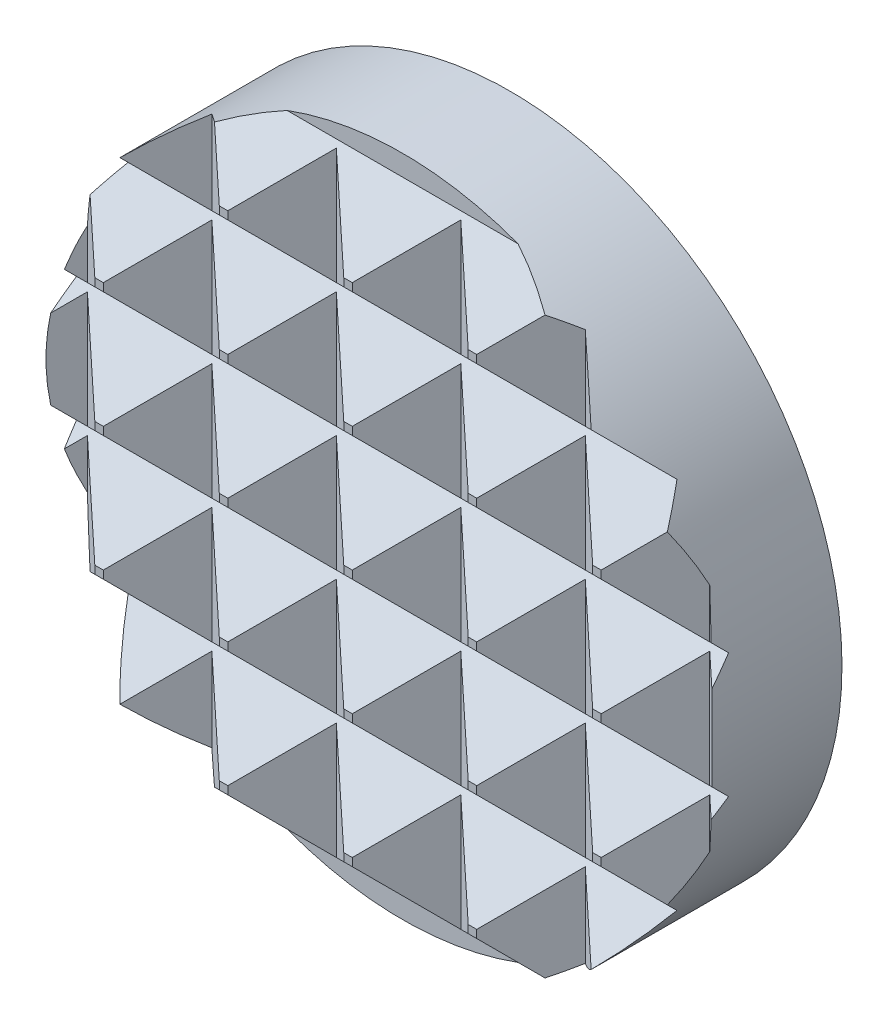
ISO-10303-21;
HEADER;
FILE_DESCRIPTION(('STEP AP214'),'2;1');
FILE_NAME('part.step','',(''),(''),'','','');
FILE_SCHEMA(('AUTOMOTIVE_DESIGN { 1 0 10303 214 1 1 1 1 }'));
ENDSEC;
DATA;
#1=APPLICATION_CONTEXT('core data for automotive mechanical design processes');
#2=APPLICATION_PROTOCOL_DEFINITION('international standard','automotive_design',2000,#1);
#3=PRODUCT_CONTEXT('',#1,'mechanical');
#4=PRODUCT('Part','Part','',(#3));
#5=PRODUCT_RELATED_PRODUCT_CATEGORY('part','',(#4));
#6=PRODUCT_DEFINITION_FORMATION('','',#4);
#7=PRODUCT_DEFINITION_CONTEXT('part definition',#1,'design');
#8=PRODUCT_DEFINITION('design','',#6,#7);
#9=PRODUCT_DEFINITION_SHAPE('','',#8);
#10=(LENGTH_UNIT() NAMED_UNIT(*) SI_UNIT(.MILLI.,.METRE.));
#11=(NAMED_UNIT(*) PLANE_ANGLE_UNIT() SI_UNIT($,.RADIAN.));
#12=(NAMED_UNIT(*) SI_UNIT($,.STERADIAN.) SOLID_ANGLE_UNIT());
#13=UNCERTAINTY_MEASURE_WITH_UNIT(LENGTH_MEASURE(1.E-05),#10,'distance_accuracy_value','');
#14=(GEOMETRIC_REPRESENTATION_CONTEXT(3) GLOBAL_UNCERTAINTY_ASSIGNED_CONTEXT((#13)) GLOBAL_UNIT_ASSIGNED_CONTEXT((#10,
#11,#12)) REPRESENTATION_CONTEXT('',''));
#15=CARTESIAN_POINT('',(0.,0.,0.));
#16=DIRECTION('',(0.,0.,1.));
#17=DIRECTION('',(1.,0.,0.));
#18=AXIS2_PLACEMENT_3D('',#15,#16,#17);
#19=CARTESIAN_POINT('',(6.351025,2.45745,3.679825));
#20=DIRECTION('',(0.,0.,-1.));
#21=DIRECTION('',(-1.,0.,0.));
#22=AXIS2_PLACEMENT_3D('',#19,#20,#21);
#23=PLANE('',#22);
#24=DIRECTION('',(-1.,0.,0.));
#25=VECTOR('',#24,1.);
#26=CARTESIAN_POINT('',(6.351025,2.30505,3.679825));
#27=LINE('',#26,#25);
#28=CARTESIAN_POINT('',(4.9149,2.30505,3.679825));
#29=VERTEX_POINT('',#28);
#30=CARTESIAN_POINT('',(4.75207948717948,2.30505,3.679825));
#31=VERTEX_POINT('',#30);
#32=EDGE_CURVE('E1039',#29,#31,#27,.T.);
#33=ORIENTED_EDGE('',*,*,#32,.F.);
#34=DIRECTION('',(0.,1.,0.));
#35=VECTOR('',#34,1.);
#36=CARTESIAN_POINT('',(4.9149,2.45745,3.679825));
#37=LINE('',#36,#35);
#38=CARTESIAN_POINT('',(4.9149,2.45745,3.679825));
#39=VERTEX_POINT('',#38);
#40=EDGE_CURVE('E29',#29,#39,#37,.T.);
#41=ORIENTED_EDGE('',*,*,#40,.T.);
#42=DIRECTION('',(-1.,0.,0.));
#43=VECTOR('',#42,1.);
#44=CARTESIAN_POINT('',(6.351025,2.45745,3.679825));
#45=LINE('',#44,#43);
#46=CARTESIAN_POINT('',(4.75207948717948,2.45745,3.679825));
#47=VERTEX_POINT('',#46);
#48=EDGE_CURVE('E1034',#39,#47,#45,.T.);
#49=ORIENTED_EDGE('',*,*,#48,.T.);
#50=DIRECTION('',(0.,-1.,0.));
#51=VECTOR('',#50,1.);
#52=CARTESIAN_POINT('',(4.75207948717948,2.45745,3.679825));
#53=LINE('',#52,#51);
#54=EDGE_CURVE('E652',#47,#31,#53,.T.);
#55=ORIENTED_EDGE('',*,*,#54,.T.);
#56=EDGE_LOOP('',(#33,#41,#49,#55));
#57=FACE_BOUND('',#56,.T.);
#58=ADVANCED_FACE('F14',(#57),#23,.F.);
#59=CARTESIAN_POINT('',(6.351025,0.0761999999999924,3.679825));
#60=DIRECTION('',(0.,0.,-1.));
#61=DIRECTION('',(-1.,0.,0.));
#62=AXIS2_PLACEMENT_3D('',#59,#60,#61);
#63=PLANE('',#62);
#64=DIRECTION('',(-1.,0.,0.));
#65=VECTOR('',#64,1.);
#66=CARTESIAN_POINT('',(6.351025,-0.0761999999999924,3.679825));
#67=LINE('',#66,#65);
#68=CARTESIAN_POINT('',(4.9149,-0.0761999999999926,3.679825));
#69=VERTEX_POINT('',#68);
#70=CARTESIAN_POINT('',(4.75207948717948,-0.0761999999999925,3.679825));
#71=VERTEX_POINT('',#70);
#72=EDGE_CURVE('E1013',#69,#71,#67,.T.);
#73=ORIENTED_EDGE('',*,*,#72,.F.);
#74=DIRECTION('',(0.,1.,0.));
#75=VECTOR('',#74,1.);
#76=CARTESIAN_POINT('',(4.9149,0.0761999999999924,3.679825));
#77=LINE('',#76,#75);
#78=CARTESIAN_POINT('',(4.9149,0.0761999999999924,3.679825));
#79=VERTEX_POINT('',#78);
#80=EDGE_CURVE('E37',#69,#79,#77,.T.);
#81=ORIENTED_EDGE('',*,*,#80,.T.);
#82=DIRECTION('',(-1.,0.,0.));
#83=VECTOR('',#82,1.);
#84=CARTESIAN_POINT('',(6.351025,0.0761999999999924,3.679825));
#85=LINE('',#84,#83);
#86=CARTESIAN_POINT('',(4.75207948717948,0.0761999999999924,3.679825));
#87=VERTEX_POINT('',#86);
#88=EDGE_CURVE('E1017',#79,#87,#85,.T.);
#89=ORIENTED_EDGE('',*,*,#88,.T.);
#90=DIRECTION('',(0.,-1.,0.));
#91=VECTOR('',#90,1.);
#92=CARTESIAN_POINT('',(4.75207948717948,0.0761999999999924,3.679825));
#93=LINE('',#92,#91);
#94=EDGE_CURVE('E643',#87,#71,#93,.T.);
#95=ORIENTED_EDGE('',*,*,#94,.T.);
#96=EDGE_LOOP('',(#73,#81,#89,#95));
#97=FACE_BOUND('',#96,.T.);
#98=ADVANCED_FACE('F1305',(#97),#63,.F.);
#99=CARTESIAN_POINT('',(6.351025,-2.30505,3.679825));
#100=DIRECTION('',(0.,0.,-1.));
#101=DIRECTION('',(-1.,0.,0.));
#102=AXIS2_PLACEMENT_3D('',#99,#100,#101);
#103=PLANE('',#102);
#104=DIRECTION('',(-1.,0.,0.));
#105=VECTOR('',#104,1.);
#106=CARTESIAN_POINT('',(6.351025,-2.45745,3.679825));
#107=LINE('',#106,#105);
#108=CARTESIAN_POINT('',(4.9149,-2.45745,3.679825));
#109=VERTEX_POINT('',#108);
#110=CARTESIAN_POINT('',(4.75207948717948,-2.45745,3.679825));
#111=VERTEX_POINT('',#110);
#112=EDGE_CURVE('E994',#109,#111,#107,.T.);
#113=ORIENTED_EDGE('',*,*,#112,.F.);
#114=DIRECTION('',(0.,1.,0.));
#115=VECTOR('',#114,1.);
#116=CARTESIAN_POINT('',(4.9149,-2.30505,3.679825));
#117=LINE('',#116,#115);
#118=CARTESIAN_POINT('',(4.9149,-2.30505,3.679825));
#119=VERTEX_POINT('',#118);
#120=EDGE_CURVE('E544',#109,#119,#117,.T.);
#121=ORIENTED_EDGE('',*,*,#120,.T.);
#122=DIRECTION('',(-1.,0.,0.));
#123=VECTOR('',#122,1.);
#124=CARTESIAN_POINT('',(6.351025,-2.30505,3.679825));
#125=LINE('',#124,#123);
#126=CARTESIAN_POINT('',(4.75207948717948,-2.30505,3.679825));
#127=VERTEX_POINT('',#126);
#128=EDGE_CURVE('E998',#119,#127,#125,.T.);
#129=ORIENTED_EDGE('',*,*,#128,.T.);
#130=DIRECTION('',(0.,-1.,0.));
#131=VECTOR('',#130,1.);
#132=CARTESIAN_POINT('',(4.75207948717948,-2.30505,3.679825));
#133=LINE('',#132,#131);
#134=EDGE_CURVE('E634',#127,#111,#133,.T.);
#135=ORIENTED_EDGE('',*,*,#134,.T.);
#136=EDGE_LOOP('',(#113,#121,#129,#135));
#137=FACE_BOUND('',#136,.T.);
#138=ADVANCED_FACE('F1117',(#137),#103,.F.);
#139=CARTESIAN_POINT('',(2.53365,2.30505,3.679825));
#140=VERTEX_POINT('',#139);
#141=CARTESIAN_POINT('',(2.37082948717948,2.30505,3.679825));
#142=VERTEX_POINT('',#141);
#143=EDGE_CURVE('E1041',#140,#142,#27,.T.);
#144=ORIENTED_EDGE('',*,*,#143,.F.);
#145=DIRECTION('',(0.,1.,0.));
#146=VECTOR('',#145,1.);
#147=CARTESIAN_POINT('',(2.53365,2.45745,3.679825));
#148=LINE('',#147,#146);
#149=CARTESIAN_POINT('',(2.53365,2.45745,3.679825));
#150=VERTEX_POINT('',#149);
#151=EDGE_CURVE('E613',#140,#150,#148,.T.);
#152=ORIENTED_EDGE('',*,*,#151,.T.);
#153=CARTESIAN_POINT('',(2.37082948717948,2.45745,3.679825));
#154=VERTEX_POINT('',#153);
#155=EDGE_CURVE('E1037',#150,#154,#45,.T.);
#156=ORIENTED_EDGE('',*,*,#155,.T.);
#157=DIRECTION('',(0.,-1.,0.));
#158=VECTOR('',#157,1.);
#159=CARTESIAN_POINT('',(2.37082948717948,2.45745,3.679825));
#160=LINE('',#159,#158);
#161=EDGE_CURVE('E735',#154,#142,#160,.T.);
#162=ORIENTED_EDGE('',*,*,#161,.T.);
#163=EDGE_LOOP('',(#144,#152,#156,#162));
#164=FACE_BOUND('',#163,.T.);
#165=ADVANCED_FACE('F1308',(#164),#23,.F.);
#166=CARTESIAN_POINT('',(2.53365,-0.0761999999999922,3.679825));
#167=VERTEX_POINT('',#166);
#168=CARTESIAN_POINT('',(2.37082948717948,-0.0761999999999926,3.679825));
#169=VERTEX_POINT('',#168);
#170=EDGE_CURVE('E1016',#167,#169,#67,.T.);
#171=ORIENTED_EDGE('',*,*,#170,.F.);
#172=DIRECTION('',(0.,1.,0.));
#173=VECTOR('',#172,1.);
#174=CARTESIAN_POINT('',(2.53365,0.0761999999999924,3.679825));
#175=LINE('',#174,#173);
#176=CARTESIAN_POINT('',(2.53365,0.0761999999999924,3.679825));
#177=VERTEX_POINT('',#176);
#178=EDGE_CURVE('E604',#167,#177,#175,.T.);
#179=ORIENTED_EDGE('',*,*,#178,.T.);
#180=CARTESIAN_POINT('',(2.37082948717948,0.0761999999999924,3.679825));
#181=VERTEX_POINT('',#180);
#182=EDGE_CURVE('E1019',#177,#181,#85,.T.);
#183=ORIENTED_EDGE('',*,*,#182,.T.);
#184=DIRECTION('',(0.,-1.,0.));
#185=VECTOR('',#184,1.);
#186=CARTESIAN_POINT('',(2.37082948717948,0.0761999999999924,3.679825));
#187=LINE('',#186,#185);
#188=EDGE_CURVE('E726',#181,#169,#187,.T.);
#189=ORIENTED_EDGE('',*,*,#188,.T.);
#190=EDGE_LOOP('',(#171,#179,#183,#189));
#191=FACE_BOUND('',#190,.T.);
#192=ADVANCED_FACE('F1315',(#191),#63,.F.);
#193=CARTESIAN_POINT('',(2.53365,-2.45745,3.679825));
#194=VERTEX_POINT('',#193);
#195=CARTESIAN_POINT('',(2.37082948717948,-2.45745,3.679825));
#196=VERTEX_POINT('',#195);
#197=EDGE_CURVE('E997',#194,#196,#107,.T.);
#198=ORIENTED_EDGE('',*,*,#197,.F.);
#199=DIRECTION('',(0.,1.,0.));
#200=VECTOR('',#199,1.);
#201=CARTESIAN_POINT('',(2.53365,-2.30505,3.679825));
#202=LINE('',#201,#200);
#203=CARTESIAN_POINT('',(2.53365,-2.30505,3.679825));
#204=VERTEX_POINT('',#203);
#205=EDGE_CURVE('E595',#194,#204,#202,.T.);
#206=ORIENTED_EDGE('',*,*,#205,.T.);
#207=CARTESIAN_POINT('',(2.37082948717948,-2.30505,3.679825));
#208=VERTEX_POINT('',#207);
#209=EDGE_CURVE('E1000',#204,#208,#125,.T.);
#210=ORIENTED_EDGE('',*,*,#209,.T.);
#211=DIRECTION('',(0.,-1.,0.));
#212=VECTOR('',#211,1.);
#213=CARTESIAN_POINT('',(2.37082948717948,-2.30505,3.679825));
#214=LINE('',#213,#212);
#215=EDGE_CURVE('E717',#208,#196,#214,.T.);
#216=ORIENTED_EDGE('',*,*,#215,.T.);
#217=EDGE_LOOP('',(#198,#206,#210,#216));
#218=FACE_BOUND('',#217,.T.);
#219=ADVANCED_FACE('F1132',(#218),#103,.F.);
#220=CARTESIAN_POINT('',(6.351,4.8387,3.679825));
#221=DIRECTION('',(0.,0.,-1.));
#222=DIRECTION('',(-1.,0.,0.));
#223=AXIS2_PLACEMENT_3D('',#220,#221,#222);
#224=PLANE('',#223);
#225=DIRECTION('',(-1.,0.,0.));
#226=VECTOR('',#225,1.);
#227=CARTESIAN_POINT('',(6.351,4.6863,3.679825));
#228=LINE('',#227,#226);
#229=CARTESIAN_POINT('',(2.53365,4.6863,3.679825));
#230=VERTEX_POINT('',#229);
#231=CARTESIAN_POINT('',(2.37082948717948,4.6863,3.679825));
#232=VERTEX_POINT('',#231);
#233=EDGE_CURVE('E1050',#230,#232,#228,.T.);
#234=ORIENTED_EDGE('',*,*,#233,.F.);
#235=DIRECTION('',(0.,1.,0.));
#236=VECTOR('',#235,1.);
#237=CARTESIAN_POINT('',(2.53365,4.8387,3.679825));
#238=LINE('',#237,#236);
#239=CARTESIAN_POINT('',(2.53365,4.8387,3.679825));
#240=VERTEX_POINT('',#239);
#241=EDGE_CURVE('E622',#230,#240,#238,.T.);
#242=ORIENTED_EDGE('',*,*,#241,.T.);
#243=DIRECTION('',(-1.,0.,0.));
#244=VECTOR('',#243,1.);
#245=CARTESIAN_POINT('',(6.351,4.8387,3.679825));
#246=LINE('',#245,#244);
#247=CARTESIAN_POINT('',(2.37082948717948,4.8387,3.679825));
#248=VERTEX_POINT('',#247);
#249=EDGE_CURVE('E1045',#240,#248,#246,.T.);
#250=ORIENTED_EDGE('',*,*,#249,.T.);
#251=DIRECTION('',(0.,-1.,0.));
#252=VECTOR('',#251,1.);
#253=CARTESIAN_POINT('',(2.37082948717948,4.8387,3.679825));
#254=LINE('',#253,#252);
#255=EDGE_CURVE('E744',#248,#232,#254,.T.);
#256=ORIENTED_EDGE('',*,*,#255,.T.);
#257=EDGE_LOOP('',(#234,#242,#250,#256));
#258=FACE_BOUND('',#257,.T.);
#259=ADVANCED_FACE('F1214',(#258),#224,.F.);
#260=CARTESIAN_POINT('',(6.351025,-4.6863,3.679825));
#261=DIRECTION('',(0.,0.,-1.));
#262=DIRECTION('',(-1.,0.,0.));
#263=AXIS2_PLACEMENT_3D('',#260,#261,#262);
#264=PLANE('',#263);
#265=DIRECTION('',(-1.,0.,0.));
#266=VECTOR('',#265,1.);
#267=CARTESIAN_POINT('',(6.351025,-4.8387,3.679825));
#268=LINE('',#267,#266);
#269=CARTESIAN_POINT('',(2.53365,-4.8387,3.679825));
#270=VERTEX_POINT('',#269);
#271=CARTESIAN_POINT('',(2.37082948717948,-4.8387,3.679825));
#272=VERTEX_POINT('',#271);
#273=EDGE_CURVE('E972',#270,#272,#268,.T.);
#274=ORIENTED_EDGE('',*,*,#273,.F.);
#275=DIRECTION('',(0.,1.,0.));
#276=VECTOR('',#275,1.);
#277=CARTESIAN_POINT('',(2.53365,-4.6863,3.679825));
#278=LINE('',#277,#276);
#279=CARTESIAN_POINT('',(2.53365,-4.6863,3.679825));
#280=VERTEX_POINT('',#279);
#281=EDGE_CURVE('E585',#270,#280,#278,.T.);
#282=ORIENTED_EDGE('',*,*,#281,.T.);
#283=DIRECTION('',(-1.,0.,0.));
#284=VECTOR('',#283,1.);
#285=CARTESIAN_POINT('',(6.351025,-4.6863,3.679825));
#286=LINE('',#285,#284);
#287=CARTESIAN_POINT('',(2.37082948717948,-4.6863,3.679825));
#288=VERTEX_POINT('',#287);
#289=EDGE_CURVE('E976',#280,#288,#286,.T.);
#290=ORIENTED_EDGE('',*,*,#289,.T.);
#291=DIRECTION('',(0.,-1.,0.));
#292=VECTOR('',#291,1.);
#293=CARTESIAN_POINT('',(2.37082948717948,-4.6863,3.679825));
#294=LINE('',#293,#292);
#295=EDGE_CURVE('E708',#288,#272,#294,.T.);
#296=ORIENTED_EDGE('',*,*,#295,.T.);
#297=EDGE_LOOP('',(#274,#282,#290,#296));
#298=FACE_BOUND('',#297,.T.);
#299=ADVANCED_FACE('F1344',(#298),#264,.F.);
#300=CARTESIAN_POINT('',(0.1524,2.30505,3.679825));
#301=VERTEX_POINT('',#300);
#302=CARTESIAN_POINT('',(-0.0104205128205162,2.30505,3.679825));
#303=VERTEX_POINT('',#302);
#304=EDGE_CURVE('E1355',#301,#303,#27,.T.);
#305=ORIENTED_EDGE('',*,*,#304,.F.);
#306=DIRECTION('',(0.,1.,0.));
#307=VECTOR('',#306,1.);
#308=CARTESIAN_POINT('',(0.1524,2.45745,3.679825));
#309=LINE('',#308,#307);
#310=CARTESIAN_POINT('',(0.1524,2.45745,3.679825));
#311=VERTEX_POINT('',#310);
#312=EDGE_CURVE('E693',#301,#311,#309,.T.);
#313=ORIENTED_EDGE('',*,*,#312,.T.);
#314=CARTESIAN_POINT('',(-0.0104205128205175,2.45745,3.679825));
#315=VERTEX_POINT('',#314);
#316=EDGE_CURVE('E1196',#311,#315,#45,.T.);
#317=ORIENTED_EDGE('',*,*,#316,.T.);
#318=DIRECTION('',(0.,-1.,0.));
#319=VECTOR('',#318,1.);
#320=CARTESIAN_POINT('',(-0.0104205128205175,2.45745,3.679825));
#321=LINE('',#320,#319);
#322=EDGE_CURVE('E824',#315,#303,#321,.T.);
#323=ORIENTED_EDGE('',*,*,#322,.T.);
#324=EDGE_LOOP('',(#305,#313,#317,#323));
#325=FACE_BOUND('',#324,.T.);
#326=ADVANCED_FACE('F1322',(#325),#23,.F.);
#327=CARTESIAN_POINT('',(0.1524,-0.0761999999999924,3.679825));
#328=VERTEX_POINT('',#327);
#329=CARTESIAN_POINT('',(-0.0104205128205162,-0.0761999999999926,3.679825));
#330=VERTEX_POINT('',#329);
#331=EDGE_CURVE('E1411',#328,#330,#67,.T.);
#332=ORIENTED_EDGE('',*,*,#331,.F.);
#333=DIRECTION('',(0.,1.,0.));
#334=VECTOR('',#333,1.);
#335=CARTESIAN_POINT('',(0.1524,0.0761999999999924,3.679825));
#336=LINE('',#335,#334);
#337=CARTESIAN_POINT('',(0.1524,0.0761999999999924,3.679825));
#338=VERTEX_POINT('',#337);
#339=EDGE_CURVE('E684',#328,#338,#336,.T.);
#340=ORIENTED_EDGE('',*,*,#339,.T.);
#341=CARTESIAN_POINT('',(-0.0104205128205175,0.0761999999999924,3.679825));
#342=VERTEX_POINT('',#341);
#343=EDGE_CURVE('E1424',#338,#342,#85,.T.);
#344=ORIENTED_EDGE('',*,*,#343,.T.);
#345=DIRECTION('',(0.,-1.,0.));
#346=VECTOR('',#345,1.);
#347=CARTESIAN_POINT('',(-0.0104205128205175,0.0761999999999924,3.679825));
#348=LINE('',#347,#346);
#349=EDGE_CURVE('E815',#342,#330,#348,.T.);
#350=ORIENTED_EDGE('',*,*,#349,.T.);
#351=EDGE_LOOP('',(#332,#340,#344,#350));
#352=FACE_BOUND('',#351,.T.);
#353=ADVANCED_FACE('F1339',(#352),#63,.F.);
#354=CARTESIAN_POINT('',(0.1524,-2.45745,3.679825));
#355=VERTEX_POINT('',#354);
#356=CARTESIAN_POINT('',(-0.0104205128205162,-2.45745,3.679825));
#357=VERTEX_POINT('',#356);
#358=EDGE_CURVE('E1135',#355,#357,#107,.T.);
#359=ORIENTED_EDGE('',*,*,#358,.F.);
#360=DIRECTION('',(0.,1.,0.));
#361=VECTOR('',#360,1.);
#362=CARTESIAN_POINT('',(0.1524,-2.30505,3.679825));
#363=LINE('',#362,#361);
#364=CARTESIAN_POINT('',(0.1524,-2.30505,3.679825));
#365=VERTEX_POINT('',#364);
#366=EDGE_CURVE('E675',#355,#365,#363,.T.);
#367=ORIENTED_EDGE('',*,*,#366,.T.);
#368=CARTESIAN_POINT('',(-0.0104205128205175,-2.30505,3.679825));
#369=VERTEX_POINT('',#368);
#370=EDGE_CURVE('E1153',#365,#369,#125,.T.);
#371=ORIENTED_EDGE('',*,*,#370,.T.);
#372=DIRECTION('',(0.,-1.,0.));
#373=VECTOR('',#372,1.);
#374=CARTESIAN_POINT('',(-0.0104205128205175,-2.30505,3.679825));
#375=LINE('',#374,#373);
#376=EDGE_CURVE('E806',#369,#357,#375,.T.);
#377=ORIENTED_EDGE('',*,*,#376,.T.);
#378=EDGE_LOOP('',(#359,#367,#371,#377));
#379=FACE_BOUND('',#378,.T.);
#380=ADVANCED_FACE('F1160',(#379),#103,.F.);
#381=CARTESIAN_POINT('',(0.1524,4.6863,3.679825));
#382=VERTEX_POINT('',#381);
#383=CARTESIAN_POINT('',(-0.0104205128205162,4.6863,3.679825));
#384=VERTEX_POINT('',#383);
#385=EDGE_CURVE('E1053',#382,#384,#228,.T.);
#386=ORIENTED_EDGE('',*,*,#385,.F.);
#387=DIRECTION('',(0.,1.,0.));
#388=VECTOR('',#387,1.);
#389=CARTESIAN_POINT('',(0.1524,4.8387,3.679825));
#390=LINE('',#389,#388);
#391=CARTESIAN_POINT('',(0.1524,4.8387,3.679825));
#392=VERTEX_POINT('',#391);
#393=EDGE_CURVE('E702',#382,#392,#390,.T.);
#394=ORIENTED_EDGE('',*,*,#393,.T.);
#395=CARTESIAN_POINT('',(-0.0104205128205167,4.8387,3.679825));
#396=VERTEX_POINT('',#395);
#397=EDGE_CURVE('E1048',#392,#396,#246,.T.);
#398=ORIENTED_EDGE('',*,*,#397,.T.);
#399=DIRECTION('',(0.,-1.,0.));
#400=VECTOR('',#399,1.);
#401=CARTESIAN_POINT('',(-0.0104205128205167,4.8387,3.679825));
#402=LINE('',#401,#400);
#403=EDGE_CURVE('E833',#396,#384,#402,.T.);
#404=ORIENTED_EDGE('',*,*,#403,.T.);
#405=EDGE_LOOP('',(#386,#394,#398,#404));
#406=FACE_BOUND('',#405,.T.);
#407=ADVANCED_FACE('F1340',(#406),#224,.F.);
#408=CARTESIAN_POINT('',(0.1524,-4.8387,3.679825));
#409=VERTEX_POINT('',#408);
#410=CARTESIAN_POINT('',(-0.0104205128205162,-4.8387,3.679825));
#411=VERTEX_POINT('',#410);
#412=EDGE_CURVE('E975',#409,#411,#268,.T.);
#413=ORIENTED_EDGE('',*,*,#412,.F.);
#414=DIRECTION('',(0.,1.,0.));
#415=VECTOR('',#414,1.);
#416=CARTESIAN_POINT('',(0.1524,-4.6863,3.679825));
#417=LINE('',#416,#415);
#418=CARTESIAN_POINT('',(0.1524,-4.6863,3.679825));
#419=VERTEX_POINT('',#418);
#420=EDGE_CURVE('E666',#409,#419,#417,.T.);
#421=ORIENTED_EDGE('',*,*,#420,.T.);
#422=CARTESIAN_POINT('',(-0.0104205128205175,-4.6863,3.679825));
#423=VERTEX_POINT('',#422);
#424=EDGE_CURVE('E978',#419,#423,#286,.T.);
#425=ORIENTED_EDGE('',*,*,#424,.T.);
#426=DIRECTION('',(0.,-1.,0.));
#427=VECTOR('',#426,1.);
#428=CARTESIAN_POINT('',(-0.0104205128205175,-4.6863,3.679825));
#429=LINE('',#428,#427);
#430=EDGE_CURVE('E797',#423,#411,#429,.T.);
#431=ORIENTED_EDGE('',*,*,#430,.T.);
#432=EDGE_LOOP('',(#413,#421,#425,#431));
#433=FACE_BOUND('',#432,.T.);
#434=ADVANCED_FACE('F1332',(#433),#264,.F.);
#435=CARTESIAN_POINT('',(-2.22885,2.30505,3.679825));
#436=VERTEX_POINT('',#435);
#437=CARTESIAN_POINT('',(-2.39167051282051,2.30505,3.679825));
#438=VERTEX_POINT('',#437);
#439=EDGE_CURVE('E1359',#436,#438,#27,.T.);
#440=ORIENTED_EDGE('',*,*,#439,.F.);
#441=DIRECTION('',(0.,1.,0.));
#442=VECTOR('',#441,1.);
#443=CARTESIAN_POINT('',(-2.22885,2.45745,3.679825));
#444=LINE('',#443,#442);
#445=CARTESIAN_POINT('',(-2.22885,2.45745,3.679825));
#446=VERTEX_POINT('',#445);
#447=EDGE_CURVE('E782',#436,#446,#444,.T.);
#448=ORIENTED_EDGE('',*,*,#447,.T.);
#449=CARTESIAN_POINT('',(-2.39167051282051,2.45745,3.679825));
#450=VERTEX_POINT('',#449);
#451=EDGE_CURVE('E1195',#446,#450,#45,.T.);
#452=ORIENTED_EDGE('',*,*,#451,.T.);
#453=DIRECTION('',(0.,-1.,0.));
#454=VECTOR('',#453,1.);
#455=CARTESIAN_POINT('',(-2.39167051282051,2.45745,3.679825));
#456=LINE('',#455,#454);
#457=EDGE_CURVE('E874',#450,#438,#456,.T.);
#458=ORIENTED_EDGE('',*,*,#457,.T.);
#459=EDGE_LOOP('',(#440,#448,#452,#458));
#460=FACE_BOUND('',#459,.T.);
#461=ADVANCED_FACE('F1324',(#460),#23,.F.);
#462=CARTESIAN_POINT('',(-2.22885,-0.0761999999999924,3.679825));
#463=VERTEX_POINT('',#462);
#464=CARTESIAN_POINT('',(-2.39167051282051,-0.0761999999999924,3.679825));
#465=VERTEX_POINT('',#464);
#466=EDGE_CURVE('E1412',#463,#465,#67,.T.);
#467=ORIENTED_EDGE('',*,*,#466,.F.);
#468=DIRECTION('',(0.,1.,0.));
#469=VECTOR('',#468,1.);
#470=CARTESIAN_POINT('',(-2.22885,0.0761999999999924,3.679825));
#471=LINE('',#470,#469);
#472=CARTESIAN_POINT('',(-2.22885,0.0761999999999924,3.679825));
#473=VERTEX_POINT('',#472);
#474=EDGE_CURVE('E773',#463,#473,#471,.T.);
#475=ORIENTED_EDGE('',*,*,#474,.T.);
#476=CARTESIAN_POINT('',(-2.39167051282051,0.0761999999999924,3.679825));
#477=VERTEX_POINT('',#476);
#478=EDGE_CURVE('E1423',#473,#477,#85,.T.);
#479=ORIENTED_EDGE('',*,*,#478,.T.);
#480=DIRECTION('',(0.,-1.,0.));
#481=VECTOR('',#480,1.);
#482=CARTESIAN_POINT('',(-2.39167051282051,0.0761999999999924,3.679825));
#483=LINE('',#482,#481);
#484=EDGE_CURVE('E865',#477,#465,#483,.T.);
#485=ORIENTED_EDGE('',*,*,#484,.T.);
#486=EDGE_LOOP('',(#467,#475,#479,#485));
#487=FACE_BOUND('',#486,.T.);
#488=ADVANCED_FACE('F1331',(#487),#63,.F.);
#489=CARTESIAN_POINT('',(-2.22885,-2.45745,3.679825));
#490=VERTEX_POINT('',#489);
#491=CARTESIAN_POINT('',(-2.39167051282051,-2.45745,3.679825));
#492=VERTEX_POINT('',#491);
#493=EDGE_CURVE('E1136',#490,#492,#107,.T.);
#494=ORIENTED_EDGE('',*,*,#493,.F.);
#495=DIRECTION('',(0.,1.,0.));
#496=VECTOR('',#495,1.);
#497=CARTESIAN_POINT('',(-2.22885,-2.30505,3.679825));
#498=LINE('',#497,#496);
#499=CARTESIAN_POINT('',(-2.22885,-2.30505,3.679825));
#500=VERTEX_POINT('',#499);
#501=EDGE_CURVE('E764',#490,#500,#498,.T.);
#502=ORIENTED_EDGE('',*,*,#501,.T.);
#503=CARTESIAN_POINT('',(-2.39167051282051,-2.30505,3.679825));
#504=VERTEX_POINT('',#503);
#505=EDGE_CURVE('E1152',#500,#504,#125,.T.);
#506=ORIENTED_EDGE('',*,*,#505,.T.);
#507=DIRECTION('',(0.,-1.,0.));
#508=VECTOR('',#507,1.);
#509=CARTESIAN_POINT('',(-2.39167051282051,-2.30505,3.679825));
#510=LINE('',#509,#508);
#511=EDGE_CURVE('E856',#504,#492,#510,.T.);
#512=ORIENTED_EDGE('',*,*,#511,.T.);
#513=EDGE_LOOP('',(#494,#502,#506,#512));
#514=FACE_BOUND('',#513,.T.);
#515=ADVANCED_FACE('F1168',(#514),#103,.F.);
#516=CARTESIAN_POINT('',(0.,0.,2.5654));
#517=DIRECTION('',(0.,0.,1.));
#518=DIRECTION('',(1.,0.,0.));
#519=AXIS2_PLACEMENT_3D('',#516,#517,#518);
#520=PLANE('',#519);
#521=CARTESIAN_POINT('',(0.,0.,2.5654));
#522=DIRECTION('',(0.,0.,1.));
#523=DIRECTION('',(1.,0.,0.));
#524=AXIS2_PLACEMENT_3D('',#521,#522,#523);
#525=CIRCLE('',#524,6.35);
#526=CARTESIAN_POINT('',(-2.20970648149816,-5.953125,2.5654));
#527=VERTEX_POINT('',#526);
#528=CARTESIAN_POINT('',(2.20970648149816,-5.953125,2.5654));
#529=VERTEX_POINT('',#528);
#530=EDGE_CURVE('E1068',#527,#529,#525,.T.);
#531=ORIENTED_EDGE('',*,*,#530,.T.);
#532=DIRECTION('',(-1.,0.,0.));
#533=VECTOR('',#532,1.);
#534=CARTESIAN_POINT('',(6.351025,-5.953125,2.5654));
#535=LINE('',#534,#533);
#536=EDGE_CURVE('E967',#529,#527,#535,.T.);
#537=ORIENTED_EDGE('',*,*,#536,.T.);
#538=EDGE_LOOP('',(#531,#537));
#539=FACE_BOUND('',#538,.T.);
#540=ADVANCED_FACE('F1920',(#539),#520,.T.);
#541=CARTESIAN_POINT('',(0.,0.,0.));
#542=DIRECTION('',(0.,0.,1.));
#543=DIRECTION('',(1.,0.,0.));
#544=AXIS2_PLACEMENT_3D('',#541,#542,#543);
#545=CYLINDRICAL_SURFACE('',#544,6.35);
#546=CARTESIAN_POINT('',(0.,0.,-2.59535958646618));
#547=DIRECTION('',(0.660500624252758,0.,-0.750825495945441));
#548=DIRECTION('',(0.750825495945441,0.,0.660500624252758));
#549=AXIS2_PLACEMENT_3D('',#546,#547,#548);
#550=ELLIPSE('',#549,8.45735798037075,6.35);
#551=CARTESIAN_POINT('',(6.29799213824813,-0.811045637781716,2.94497936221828));
#552=VERTEX_POINT('',#551);
#553=CARTESIAN_POINT('',(6.29799213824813,0.811045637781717,2.94497936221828));
#554=VERTEX_POINT('',#553);
#555=EDGE_CURVE('E561',#552,#554,#550,.F.);
#556=ORIENTED_EDGE('',*,*,#555,.F.);
#557=CARTESIAN_POINT('',(0.,0.,3.756025));
#558=DIRECTION('',(0.,0.707106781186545,-0.70710678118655));
#559=DIRECTION('',(0.,0.70710678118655,0.707106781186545));
#560=AXIS2_PLACEMENT_3D('',#557,#558,#559);
#561=ELLIPSE('',#560,8.98025612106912,6.35);
#562=CARTESIAN_POINT('',(6.23738022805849,-1.190625,2.5654));
#563=VERTEX_POINT('',#562);
#564=EDGE_CURVE('E1020',#552,#563,#561,.T.);
#565=ORIENTED_EDGE('',*,*,#564,.T.);
#566=CARTESIAN_POINT('',(0.,0.,1.374775));
#567=DIRECTION('',(0.,-0.707106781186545,-0.70710678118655));
#568=DIRECTION('',(0.,-0.70710678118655,0.707106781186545));
#569=AXIS2_PLACEMENT_3D('',#566,#567,#568);
#570=ELLIPSE('',#569,8.98025612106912,6.35);
#571=CARTESIAN_POINT('',(6.17864443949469,-1.46521428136,2.83998928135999));
#572=VERTEX_POINT('',#571);
#573=EDGE_CURVE('E557',#563,#572,#570,.T.);
#574=ORIENTED_EDGE('',*,*,#573,.T.);
#575=CARTESIAN_POINT('',(5.953125,-2.20970648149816,2.6416));
#576=VERTEX_POINT('',#575);
#577=EDGE_CURVE('E549',#576,#572,#550,.F.);
#578=ORIENTED_EDGE('',*,*,#577,.F.);
#579=CARTESIAN_POINT('',(0.,0.,8.594725));
#580=DIRECTION('',(-0.707106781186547,0.,-0.707106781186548));
#581=DIRECTION('',(-0.707106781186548,0.,0.707106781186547));
#582=AXIS2_PLACEMENT_3D('',#579,#580,#581);
#583=ELLIPSE('',#582,8.98025612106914,6.35);
#584=CARTESIAN_POINT('',(5.54746149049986,-3.09001149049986,3.04726350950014));
#585=VERTEX_POINT('',#584);
#586=EDGE_CURVE('E535',#585,#576,#583,.F.);
#587=ORIENTED_EDGE('',*,*,#586,.F.);
#588=CARTESIAN_POINT('',(0.,0.,6.137275));
#589=DIRECTION('',(0.,0.707106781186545,-0.70710678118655));
#590=DIRECTION('',(0.,0.70710678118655,0.707106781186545));
#591=AXIS2_PLACEMENT_3D('',#588,#589,#590);
#592=ELLIPSE('',#591,8.98025612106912,6.35);
#593=CARTESIAN_POINT('',(5.2501627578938,-3.571875,2.5654));
#594=VERTEX_POINT('',#593);
#595=EDGE_CURVE('E1001',#585,#594,#592,.T.);
#596=ORIENTED_EDGE('',*,*,#595,.T.);
#597=CARTESIAN_POINT('',(0.,0.,-1.006475));
#598=DIRECTION('',(0.,-0.707106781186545,-0.70710678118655));
#599=DIRECTION('',(0.,-0.70710678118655,0.707106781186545));
#600=AXIS2_PLACEMENT_3D('',#597,#598,#599);
#601=ELLIPSE('',#600,8.98025612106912,6.35);
#602=CARTESIAN_POINT('',(4.5083184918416,-4.47186363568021,3.4653886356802));
#603=VERTEX_POINT('',#602);
#604=EDGE_CURVE('E983',#594,#603,#601,.T.);
#605=ORIENTED_EDGE('',*,*,#604,.T.);
#606=CARTESIAN_POINT('',(0.,0.,-0.500575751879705));
#607=DIRECTION('',(0.660500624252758,0.,-0.750825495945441));
#608=DIRECTION('',(0.750825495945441,0.,0.660500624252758));
#609=AXIS2_PLACEMENT_3D('',#606,#607,#608);
#610=ELLIPSE('',#609,8.45735798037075,6.35);
#611=CARTESIAN_POINT('',(3.571875,-5.2501627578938,2.6416));
#612=VERTEX_POINT('',#611);
#613=EDGE_CURVE('E628',#612,#603,#610,.F.);
#614=ORIENTED_EDGE('',*,*,#613,.F.);
#615=CARTESIAN_POINT('',(0.,0.,6.213475));
#616=DIRECTION('',(-0.707106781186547,0.,-0.707106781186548));
#617=DIRECTION('',(-0.707106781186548,0.,0.707106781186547));
#618=AXIS2_PLACEMENT_3D('',#615,#616,#617);
#619=ELLIPSE('',#618,8.98025612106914,6.35);
#620=CARTESIAN_POINT('',(3.18716809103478,-5.49221809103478,3.02630690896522));
#621=VERTEX_POINT('',#620);
#622=EDGE_CURVE('E583',#621,#612,#619,.F.);
#623=ORIENTED_EDGE('',*,*,#622,.F.);
#624=CARTESIAN_POINT('',(0.,0.,8.518525));
#625=DIRECTION('',(0.,0.707106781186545,-0.70710678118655));
#626=DIRECTION('',(0.,0.70710678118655,0.707106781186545));
#627=AXIS2_PLACEMENT_3D('',#624,#625,#626);
#628=ELLIPSE('',#627,8.98025612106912,6.35);
#629=EDGE_CURVE('E980',#621,#529,#628,.T.);
#630=ORIENTED_EDGE('',*,*,#629,.T.);
#631=ORIENTED_EDGE('',*,*,#530,.F.);
#632=CARTESIAN_POINT('',(0.,0.,8.518525));
#633=DIRECTION('',(0.,-0.707106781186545,0.70710678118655));
#634=DIRECTION('',(0.,0.70710678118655,0.707106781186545));
#635=AXIS2_PLACEMENT_3D('',#632,#633,#634);
#636=ELLIPSE('',#635,8.98025612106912,6.35);
#637=CARTESIAN_POINT('',(-3.15538529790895,-5.51053932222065,3.00798567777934));
#638=VERTEX_POINT('',#637);
#639=EDGE_CURVE('E974',#638,#527,#636,.T.);
#640=ORIENTED_EDGE('',*,*,#639,.F.);
#641=CARTESIAN_POINT('',(0.,0.,5.78377575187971));
#642=DIRECTION('',(0.660500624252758,0.,-0.750825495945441));
#643=DIRECTION('',(0.750825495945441,0.,0.660500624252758));
#644=AXIS2_PLACEMENT_3D('',#641,#642,#643);
#645=ELLIPSE('',#644,8.45735798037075,6.35);
#646=CARTESIAN_POINT('',(-3.571875,-5.2501627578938,2.6416));
#647=VERTEX_POINT('',#646);
#648=EDGE_CURVE('E847',#647,#638,#645,.F.);
#649=ORIENTED_EDGE('',*,*,#648,.F.);
#650=CARTESIAN_POINT('',(0.,0.,-0.930275));
#651=DIRECTION('',(-0.707106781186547,0.,-0.707106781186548));
#652=DIRECTION('',(-0.707106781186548,0.,0.707106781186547));
#653=AXIS2_PLACEMENT_3D('',#650,#651,#652);
#654=ELLIPSE('',#653,8.98025612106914,6.35);
#655=CARTESIAN_POINT('',(-4.45186641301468,-4.52806641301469,3.52159141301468));
#656=VERTEX_POINT('',#655);
#657=EDGE_CURVE('E889',#656,#647,#654,.F.);
#658=ORIENTED_EDGE('',*,*,#657,.F.);
#659=CARTESIAN_POINT('',(0.,0.,-1.006475));
#660=DIRECTION('',(0.,0.707106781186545,0.70710678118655));
#661=DIRECTION('',(0.,-0.70710678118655,0.707106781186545));
#662=AXIS2_PLACEMENT_3D('',#659,#660,#661);
#663=ELLIPSE('',#662,8.98025612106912,6.35);
#664=CARTESIAN_POINT('',(-5.2501627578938,-3.571875,2.5654));
#665=VERTEX_POINT('',#664);
#666=EDGE_CURVE('E971',#665,#656,#663,.T.);
#667=ORIENTED_EDGE('',*,*,#666,.F.);
#668=CARTESIAN_POINT('',(0.,0.,6.137275));
#669=DIRECTION('',(0.,-0.707106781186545,0.70710678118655));
#670=DIRECTION('',(0.,0.70710678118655,0.707106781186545));
#671=AXIS2_PLACEMENT_3D('',#668,#669,#670);
#672=ELLIPSE('',#671,8.98025612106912,6.35);
#673=CARTESIAN_POINT('',(-5.52913289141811,-3.12268946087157,3.01458553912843));
#674=VERTEX_POINT('',#673);
#675=EDGE_CURVE('E996',#674,#665,#672,.T.);
#676=ORIENTED_EDGE('',*,*,#675,.F.);
#677=CARTESIAN_POINT('',(0.,0.,7.87855958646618));
#678=DIRECTION('',(0.660500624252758,0.,-0.750825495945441));
#679=DIRECTION('',(0.750825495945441,0.,0.660500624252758));
#680=AXIS2_PLACEMENT_3D('',#677,#678,#679);
#681=ELLIPSE('',#680,8.45735798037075,6.35);
#682=CARTESIAN_POINT('',(-5.953125,-2.20970648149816,2.6416));
#683=VERTEX_POINT('',#682);
#684=EDGE_CURVE('E930',#683,#674,#681,.F.);
#685=ORIENTED_EDGE('',*,*,#684,.F.);
#686=CARTESIAN_POINT('',(0.,0.,-3.311525));
#687=DIRECTION('',(-0.707106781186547,0.,-0.707106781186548));
#688=DIRECTION('',(-0.707106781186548,0.,0.707106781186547));
#689=AXIS2_PLACEMENT_3D('',#686,#687,#688);
#690=ELLIPSE('',#689,8.98025612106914,6.35);
#691=CARTESIAN_POINT('',(-6.17341083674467,-1.48711083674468,2.86188583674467));
#692=VERTEX_POINT('',#691);
#693=EDGE_CURVE('E954',#692,#683,#690,.F.);
#694=ORIENTED_EDGE('',*,*,#693,.F.);
#695=CARTESIAN_POINT('',(0.,0.,1.374775));
#696=DIRECTION('',(0.,0.707106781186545,0.70710678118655));
#697=DIRECTION('',(0.,-0.70710678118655,0.707106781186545));
#698=AXIS2_PLACEMENT_3D('',#695,#696,#697);
#699=ELLIPSE('',#698,8.98025612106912,6.35);
#700=CARTESIAN_POINT('',(-6.23738022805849,-1.190625,2.5654));
#701=VERTEX_POINT('',#700);
#702=EDGE_CURVE('E993',#701,#692,#699,.T.);
#703=ORIENTED_EDGE('',*,*,#702,.F.);
#704=CARTESIAN_POINT('',(0.,0.,3.756025));
#705=DIRECTION('',(0.,-0.707106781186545,0.70710678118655));
#706=DIRECTION('',(0.,0.70710678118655,0.707106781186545));
#707=AXIS2_PLACEMENT_3D('',#704,#705,#706);
#708=ELLIPSE('',#707,8.98025612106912,6.35);
#709=CARTESIAN_POINT('',(-6.30391655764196,-0.763633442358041,2.99239155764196));
#710=VERTEX_POINT('',#709);
#711=EDGE_CURVE('E1015',#710,#701,#708,.T.);
#712=ORIENTED_EDGE('',*,*,#711,.F.);
#713=CARTESIAN_POINT('',(-6.30391655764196,0.763633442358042,2.99239155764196));
#714=VERTEX_POINT('',#713);
#715=EDGE_CURVE('E958',#714,#710,#690,.F.);
#716=ORIENTED_EDGE('',*,*,#715,.F.);
#717=CARTESIAN_POINT('',(0.,0.,3.756025));
#718=DIRECTION('',(0.,0.707106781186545,0.70710678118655));
#719=DIRECTION('',(0.,-0.70710678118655,0.707106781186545));
#720=AXIS2_PLACEMENT_3D('',#717,#718,#719);
#721=ELLIPSE('',#720,8.98025612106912,6.35);
#722=CARTESIAN_POINT('',(-6.23738022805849,1.190625,2.5654));
#723=VERTEX_POINT('',#722);
#724=EDGE_CURVE('E1012',#723,#714,#721,.T.);
#725=ORIENTED_EDGE('',*,*,#724,.F.);
#726=CARTESIAN_POINT('',(0.,0.,1.374775));
#727=DIRECTION('',(0.,-0.707106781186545,0.70710678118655));
#728=DIRECTION('',(0.,0.70710678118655,0.707106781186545));
#729=AXIS2_PLACEMENT_3D('',#726,#727,#728);
#730=ELLIPSE('',#729,8.98025612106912,6.35);
#731=CARTESIAN_POINT('',(-6.17341083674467,1.48711083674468,2.86188583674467));
#732=VERTEX_POINT('',#731);
#733=EDGE_CURVE('E1022',#732,#723,#730,.T.);
#734=ORIENTED_EDGE('',*,*,#733,.F.);
#735=CARTESIAN_POINT('',(-5.953125,2.20970648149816,2.6416));
#736=VERTEX_POINT('',#735);
#737=EDGE_CURVE('E957',#736,#732,#690,.F.);
#738=ORIENTED_EDGE('',*,*,#737,.F.);
#739=CARTESIAN_POINT('',(-5.52913289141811,3.12268946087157,3.01458553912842));
#740=VERTEX_POINT('',#739);
#741=EDGE_CURVE('E933',#740,#736,#681,.F.);
#742=ORIENTED_EDGE('',*,*,#741,.F.);
#743=CARTESIAN_POINT('',(0.,0.,6.137275));
#744=DIRECTION('',(0.,0.707106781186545,0.70710678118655));
#745=DIRECTION('',(0.,-0.70710678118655,0.707106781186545));
#746=AXIS2_PLACEMENT_3D('',#743,#744,#745);
#747=ELLIPSE('',#746,8.98025612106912,6.35);
#748=CARTESIAN_POINT('',(-5.2501627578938,3.571875,2.5654));
#749=VERTEX_POINT('',#748);
#750=EDGE_CURVE('E1029',#749,#740,#747,.T.);
#751=ORIENTED_EDGE('',*,*,#750,.F.);
#752=CARTESIAN_POINT('',(0.,0.,-1.006475));
#753=DIRECTION('',(0.,-0.707106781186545,0.70710678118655));
#754=DIRECTION('',(0.,0.70710678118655,0.707106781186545));
#755=AXIS2_PLACEMENT_3D('',#752,#753,#754);
#756=ELLIPSE('',#755,8.98025612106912,6.35);
#757=CARTESIAN_POINT('',(-4.45186641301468,4.52806641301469,3.52159141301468));
#758=VERTEX_POINT('',#757);
#759=EDGE_CURVE('E1032',#758,#749,#756,.T.);
#760=ORIENTED_EDGE('',*,*,#759,.F.);
#761=CARTESIAN_POINT('',(-3.571875,5.2501627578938,2.6416));
#762=VERTEX_POINT('',#761);
#763=EDGE_CURVE('E892',#762,#758,#654,.F.);
#764=ORIENTED_EDGE('',*,*,#763,.F.);
#765=CARTESIAN_POINT('',(-3.15538529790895,5.51053932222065,3.00798567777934));
#766=VERTEX_POINT('',#765);
#767=EDGE_CURVE('E850',#766,#762,#645,.F.);
#768=ORIENTED_EDGE('',*,*,#767,.F.);
#769=CARTESIAN_POINT('',(0.,0.,8.518525));
#770=DIRECTION('',(0.,0.707106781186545,0.70710678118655));
#771=DIRECTION('',(0.,-0.70710678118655,0.707106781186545));
#772=AXIS2_PLACEMENT_3D('',#769,#770,#771);
#773=ELLIPSE('',#772,8.98025612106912,6.35);
#774=CARTESIAN_POINT('',(-2.20970648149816,5.953125,2.5654));
#775=VERTEX_POINT('',#774);
#776=EDGE_CURVE('E1060',#775,#766,#773,.T.);
#777=ORIENTED_EDGE('',*,*,#776,.F.);
#778=CARTESIAN_POINT('',(2.20970648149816,5.953125,2.5654));
#779=VERTEX_POINT('',#778);
#780=EDGE_CURVE('E1073',#779,#775,#525,.T.);
#781=ORIENTED_EDGE('',*,*,#780,.F.);
#782=CARTESIAN_POINT('',(0.,0.,8.518525));
#783=DIRECTION('',(0.,-0.707106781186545,-0.70710678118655));
#784=DIRECTION('',(0.,-0.70710678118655,0.707106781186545));
#785=AXIS2_PLACEMENT_3D('',#782,#783,#784);
#786=ELLIPSE('',#785,8.98025612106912,6.35);
#787=CARTESIAN_POINT('',(3.18716809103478,5.49221809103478,3.02630690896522));
#788=VERTEX_POINT('',#787);
#789=EDGE_CURVE('E1056',#779,#788,#786,.T.);
#790=ORIENTED_EDGE('',*,*,#789,.T.);
#791=CARTESIAN_POINT('',(3.571875,5.2501627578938,2.6416));
#792=VERTEX_POINT('',#791);
#793=EDGE_CURVE('E586',#792,#788,#619,.F.);
#794=ORIENTED_EDGE('',*,*,#793,.F.);
#795=CARTESIAN_POINT('',(4.5083184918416,4.47186363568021,3.46538863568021));
#796=VERTEX_POINT('',#795);
#797=EDGE_CURVE('E631',#796,#792,#610,.F.);
#798=ORIENTED_EDGE('',*,*,#797,.F.);
#799=CARTESIAN_POINT('',(0.,0.,-1.006475));
#800=DIRECTION('',(0.,0.707106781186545,-0.70710678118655));
#801=DIRECTION('',(0.,0.70710678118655,0.707106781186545));
#802=AXIS2_PLACEMENT_3D('',#799,#800,#801);
#803=ELLIPSE('',#802,8.98025612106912,6.35);
#804=CARTESIAN_POINT('',(5.2501627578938,3.571875,2.5654));
#805=VERTEX_POINT('',#804);
#806=EDGE_CURVE('E1065',#796,#805,#803,.T.);
#807=ORIENTED_EDGE('',*,*,#806,.T.);
#808=CARTESIAN_POINT('',(0.,0.,6.137275));
#809=DIRECTION('',(0.,-0.707106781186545,-0.70710678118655));
#810=DIRECTION('',(0.,-0.70710678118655,0.707106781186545));
#811=AXIS2_PLACEMENT_3D('',#808,#809,#810);
#812=ELLIPSE('',#811,8.98025612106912,6.35);
#813=CARTESIAN_POINT('',(5.54746149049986,3.09001149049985,3.04726350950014));
#814=VERTEX_POINT('',#813);
#815=EDGE_CURVE('E1033',#805,#814,#812,.T.);
#816=ORIENTED_EDGE('',*,*,#815,.T.);
#817=CARTESIAN_POINT('',(5.953125,2.20970648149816,2.6416));
#818=VERTEX_POINT('',#817);
#819=EDGE_CURVE('E546',#818,#814,#583,.F.);
#820=ORIENTED_EDGE('',*,*,#819,.F.);
#821=CARTESIAN_POINT('',(6.17864443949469,1.46521428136,2.83998928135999));
#822=VERTEX_POINT('',#821);
#823=EDGE_CURVE('E560',#822,#818,#550,.F.);
#824=ORIENTED_EDGE('',*,*,#823,.F.);
#825=CARTESIAN_POINT('',(0.,0.,1.374775));
#826=DIRECTION('',(0.,0.707106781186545,-0.70710678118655));
#827=DIRECTION('',(0.,0.70710678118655,0.707106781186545));
#828=AXIS2_PLACEMENT_3D('',#825,#826,#827);
#829=ELLIPSE('',#828,8.98025612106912,6.35);
#830=CARTESIAN_POINT('',(6.23738022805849,1.190625,2.5654));
#831=VERTEX_POINT('',#830);
#832=EDGE_CURVE('E1030',#822,#831,#829,.T.);
#833=ORIENTED_EDGE('',*,*,#832,.T.);
#834=CARTESIAN_POINT('',(0.,0.,3.756025));
#835=DIRECTION('',(0.,-0.707106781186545,-0.70710678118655));
#836=DIRECTION('',(0.,-0.70710678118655,0.707106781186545));
#837=AXIS2_PLACEMENT_3D('',#834,#835,#836);
#838=ELLIPSE('',#837,8.98025612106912,6.35);
#839=EDGE_CURVE('E1023',#831,#554,#838,.T.);
#840=ORIENTED_EDGE('',*,*,#839,.T.);
#841=EDGE_LOOP('',(#556,#565,#574,#578,#587,#596,#605,#614,#623,#630,#631,#640,#649,#658,#667,
#676,#685,#694,#703,#712,#716,#725,#734,#738,#742,#751,#760,#764,#768,#777,#781,#790,#794,#798,
#807,#816,#820,#824,#833,#840));
#842=FACE_BOUND('',#841,.T.);
#843=CARTESIAN_POINT('',(0.,0.,0.508));
#844=DIRECTION('',(0.,0.,-1.));
#845=DIRECTION('',(-1.,0.,0.));
#846=AXIS2_PLACEMENT_3D('',#843,#844,#845);
#847=CIRCLE('',#846,6.35);
#848=CARTESIAN_POINT('',(-6.35,0.,0.508));
#849=VERTEX_POINT('',#848);
#850=EDGE_CURVE('E1064',#849,#849,#847,.T.);
#851=ORIENTED_EDGE('',*,*,#850,.F.);
#852=EDGE_LOOP('',(#851));
#853=FACE_BOUND('',#852,.T.);
#854=ADVANCED_FACE('F16',(#842,#853),#545,.T.);
#855=DIRECTION('',(-1.,0.,0.));
#856=VECTOR('',#855,1.);
#857=CARTESIAN_POINT('',(6.351,5.953125,2.5654));
#858=LINE('',#857,#856);
#859=EDGE_CURVE('E1057',#779,#775,#858,.T.);
#860=ORIENTED_EDGE('',*,*,#859,.F.);
#861=ORIENTED_EDGE('',*,*,#780,.T.);
#862=EDGE_LOOP('',(#860,#861));
#863=FACE_BOUND('',#862,.T.);
#864=ADVANCED_FACE('F1923',(#863),#520,.T.);
#865=CARTESIAN_POINT('',(0.,0.,0.508));
#866=DIRECTION('',(0.,0.,-1.));
#867=DIRECTION('',(-1.,0.,0.));
#868=AXIS2_PLACEMENT_3D('',#865,#866,#867);
#869=PLANE('',#868);
#870=CARTESIAN_POINT('',(0.,0.,0.508));
#871=DIRECTION('',(0.,0.,-1.));
#872=DIRECTION('',(-1.,0.,0.));
#873=AXIS2_PLACEMENT_3D('',#870,#871,#872);
#874=CIRCLE('',#873,6.096);
#875=CARTESIAN_POINT('',(-6.096,0.,0.508));
#876=VERTEX_POINT('',#875);
#877=EDGE_CURVE('E1061',#876,#876,#874,.T.);
#878=ORIENTED_EDGE('',*,*,#877,.F.);
#879=EDGE_LOOP('',(#878));
#880=FACE_BOUND('',#879,.T.);
#881=ORIENTED_EDGE('',*,*,#850,.T.);
#882=EDGE_LOOP('',(#881));
#883=FACE_BOUND('',#882,.T.);
#884=ADVANCED_FACE('F1930',(#880,#883),#869,.T.);
#885=CARTESIAN_POINT('',(0.,0.,0.));
#886=DIRECTION('',(0.,0.,1.));
#887=DIRECTION('',(1.,0.,0.));
#888=AXIS2_PLACEMENT_3D('',#885,#886,#887);
#889=PLANE('',#888);
#890=CARTESIAN_POINT('',(0.,0.,0.));
#891=DIRECTION('',(0.,0.,1.));
#892=DIRECTION('',(1.,0.,0.));
#893=AXIS2_PLACEMENT_3D('',#890,#891,#892);
#894=CIRCLE('',#893,5.588);
#895=CARTESIAN_POINT('',(5.588,0.,0.));
#896=VERTEX_POINT('',#895);
#897=EDGE_CURVE('E1069',#896,#896,#894,.F.);
#898=ORIENTED_EDGE('',*,*,#897,.T.);
#899=EDGE_LOOP('',(#898));
#900=FACE_BOUND('',#899,.T.);
#901=ADVANCED_FACE('F1935',(#900),#889,.F.);
#902=CARTESIAN_POINT('',(0.,0.,0.));
#903=DIRECTION('',(0.,0.,1.));
#904=DIRECTION('',(1.,0.,0.));
#905=AXIS2_PLACEMENT_3D('',#902,#903,#904);
#906=CONICAL_SURFACE('',#905,5.588,0.785398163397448);
#907=ORIENTED_EDGE('',*,*,#877,.T.);
#908=EDGE_LOOP('',(#907));
#909=FACE_BOUND('',#908,.T.);
#910=ORIENTED_EDGE('',*,*,#897,.F.);
#911=EDGE_LOOP('',(#910));
#912=FACE_BOUND('',#911,.T.);
#913=ADVANCED_FACE('F1940',(#909,#912),#906,.T.);
#914=CARTESIAN_POINT('',(6.351,5.953125,2.5654));
#915=DIRECTION('',(0.,-0.707106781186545,-0.70710678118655));
#916=DIRECTION('',(0.,0.70710678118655,-0.707106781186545));
#917=AXIS2_PLACEMENT_3D('',#914,#915,#916);
#918=PLANE('',#917);
#919=ORIENTED_EDGE('',*,*,#249,.F.);
#920=DIRECTION('',(0.577350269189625,0.577350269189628,-0.577350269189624));
#921=VECTOR('',#920,1.);
#922=CARTESIAN_POINT('',(4.54905,6.8541,1.664425));
#923=LINE('',#922,#921);
#924=EDGE_CURVE('E625',#240,#788,#923,.T.);
#925=ORIENTED_EDGE('',*,*,#924,.T.);
#926=ORIENTED_EDGE('',*,*,#789,.F.);
#927=ORIENTED_EDGE('',*,*,#859,.T.);
#928=ORIENTED_EDGE('',*,*,#776,.T.);
#929=DIRECTION('',(0.626501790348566,-0.55113315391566,0.551133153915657));
#930=VECTOR('',#929,1.);
#931=CARTESIAN_POINT('',(0.270276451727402,2.49698725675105,6.02153774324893));
#932=LINE('',#931,#930);
#933=CARTESIAN_POINT('',(-2.39167051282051,4.8387,3.679825));
#934=VERTEX_POINT('',#933);
#935=EDGE_CURVE('E886',#766,#934,#932,.T.);
#936=ORIENTED_EDGE('',*,*,#935,.T.);
#937=CARTESIAN_POINT('',(-2.22885,4.8387,3.679825));
#938=VERTEX_POINT('',#937);
#939=EDGE_CURVE('E1049',#938,#934,#246,.T.);
#940=ORIENTED_EDGE('',*,*,#939,.F.);
#941=DIRECTION('',(0.577350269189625,0.577350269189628,-0.577350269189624));
#942=VECTOR('',#941,1.);
#943=CARTESIAN_POINT('',(1.37405,8.4416,0.076925));
#944=LINE('',#943,#942);
#945=CARTESIAN_POINT('',(-1.190625,5.876925,2.6416));
#946=VERTEX_POINT('',#945);
#947=EDGE_CURVE('E794',#938,#946,#944,.T.);
#948=ORIENTED_EDGE('',*,*,#947,.T.);
#949=DIRECTION('',(0.626501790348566,-0.55113315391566,0.551133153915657));
#950=VECTOR('',#949,1.);
#951=CARTESIAN_POINT('',(1.71687512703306,3.31919932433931,5.19932567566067));
#952=LINE('',#951,#950);
#953=EDGE_CURVE('E836',#946,#396,#952,.T.);
#954=ORIENTED_EDGE('',*,*,#953,.T.);
#955=ORIENTED_EDGE('',*,*,#397,.F.);
#956=DIRECTION('',(0.577350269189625,0.577350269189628,-0.577350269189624));
#957=VECTOR('',#956,1.);
#958=CARTESIAN_POINT('',(2.96155,7.64785,0.870675));
#959=LINE('',#958,#957);
#960=CARTESIAN_POINT('',(1.190625,5.876925,2.6416));
#961=VERTEX_POINT('',#960);
#962=EDGE_CURVE('E705',#392,#961,#959,.T.);
#963=ORIENTED_EDGE('',*,*,#962,.T.);
#964=DIRECTION('',(0.626501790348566,-0.55113315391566,0.551133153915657));
#965=VECTOR('',#964,1.);
#966=CARTESIAN_POINT('',(3.16347380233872,4.14141139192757,4.37711360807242));
#967=LINE('',#966,#965);
#968=EDGE_CURVE('E747',#961,#248,#967,.T.);
#969=ORIENTED_EDGE('',*,*,#968,.T.);
#970=EDGE_LOOP('',(#919,#925,#926,#927,#928,#936,#940,#948,#954,#955,#963,#969));
#971=FACE_BOUND('',#970,.T.);
#972=ADVANCED_FACE('F1208',(#971),#918,.F.);
#973=CARTESIAN_POINT('',(-2.22885,4.6863,3.679825));
#974=VERTEX_POINT('',#973);
#975=CARTESIAN_POINT('',(-2.39167051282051,4.6863,3.679825));
#976=VERTEX_POINT('',#975);
#977=EDGE_CURVE('E1047',#974,#976,#228,.T.);
#978=ORIENTED_EDGE('',*,*,#977,.F.);
#979=DIRECTION('',(0.,1.,0.));
#980=VECTOR('',#979,1.);
#981=CARTESIAN_POINT('',(-2.22885,4.8387,3.679825));
#982=LINE('',#981,#980);
#983=EDGE_CURVE('E791',#974,#938,#982,.T.);
#984=ORIENTED_EDGE('',*,*,#983,.T.);
#985=ORIENTED_EDGE('',*,*,#939,.T.);
#986=DIRECTION('',(0.,-1.,0.));
#987=VECTOR('',#986,1.);
#988=CARTESIAN_POINT('',(-2.39167051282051,4.8387,3.679825));
#989=LINE('',#988,#987);
#990=EDGE_CURVE('E883',#934,#976,#989,.T.);
#991=ORIENTED_EDGE('',*,*,#990,.T.);
#992=EDGE_LOOP('',(#978,#984,#985,#991));
#993=FACE_BOUND('',#992,.T.);
#994=ADVANCED_FACE('F1232',(#993),#224,.F.);
#995=CARTESIAN_POINT('',(6.351,3.571875,2.5654));
#996=DIRECTION('',(0.,0.707106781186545,-0.70710678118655));
#997=DIRECTION('',(0.,0.70710678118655,0.707106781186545));
#998=AXIS2_PLACEMENT_3D('',#995,#996,#997);
#999=PLANE('',#998);
#1000=ORIENTED_EDGE('',*,*,#806,.F.);
#1001=DIRECTION('',(-0.626501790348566,-0.55113315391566,-0.551133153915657));
#1002=VECTOR('',#1001,1.);
#1003=CARTESIAN_POINT('',(4.61007247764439,4.56137654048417,3.55490154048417));
#1004=LINE('',#1003,#1002);
#1005=CARTESIAN_POINT('',(3.571875,3.648075,2.6416));
#1006=VERTEX_POINT('',#1005);
#1007=EDGE_CURVE('E658',#796,#1006,#1004,.T.);
#1008=ORIENTED_EDGE('',*,*,#1007,.T.);
#1009=DIRECTION('',(-0.577350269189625,0.577350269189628,0.577350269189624));
#1010=VECTOR('',#1009,1.);
#1011=CARTESIAN_POINT('',(4.54905,2.6709,1.664425));
#1012=LINE('',#1011,#1010);
#1013=EDGE_CURVE('E619',#1006,#230,#1012,.T.);
#1014=ORIENTED_EDGE('',*,*,#1013,.T.);
#1015=ORIENTED_EDGE('',*,*,#233,.T.);
#1016=DIRECTION('',(-0.626501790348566,-0.55113315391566,-0.551133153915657));
#1017=VECTOR('',#1016,1.);
#1018=CARTESIAN_POINT('',(3.16347380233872,5.38358860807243,4.37711360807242));
#1019=LINE('',#1018,#1017);
#1020=CARTESIAN_POINT('',(1.190625,3.648075,2.6416));
#1021=VERTEX_POINT('',#1020);
#1022=EDGE_CURVE('E741',#232,#1021,#1019,.T.);
#1023=ORIENTED_EDGE('',*,*,#1022,.T.);
#1024=DIRECTION('',(-0.577350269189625,0.577350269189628,0.577350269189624));
#1025=VECTOR('',#1024,1.);
#1026=CARTESIAN_POINT('',(2.96155,1.87715,0.870675));
#1027=LINE('',#1026,#1025);
#1028=EDGE_CURVE('E699',#1021,#382,#1027,.T.);
#1029=ORIENTED_EDGE('',*,*,#1028,.T.);
#1030=ORIENTED_EDGE('',*,*,#385,.T.);
#1031=DIRECTION('',(-0.626501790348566,-0.55113315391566,-0.551133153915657));
#1032=VECTOR('',#1031,1.);
#1033=CARTESIAN_POINT('',(1.71687512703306,6.20580067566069,5.19932567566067));
#1034=LINE('',#1033,#1032);
#1035=CARTESIAN_POINT('',(-1.190625,3.648075,2.6416));
#1036=VERTEX_POINT('',#1035);
#1037=EDGE_CURVE('E830',#384,#1036,#1034,.T.);
#1038=ORIENTED_EDGE('',*,*,#1037,.T.);
#1039=DIRECTION('',(-0.577350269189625,0.577350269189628,0.577350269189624));
#1040=VECTOR('',#1039,1.);
#1041=CARTESIAN_POINT('',(1.37405,1.0834,0.076925));
#1042=LINE('',#1041,#1040);
#1043=EDGE_CURVE('E788',#1036,#974,#1042,.T.);
#1044=ORIENTED_EDGE('',*,*,#1043,.T.);
#1045=ORIENTED_EDGE('',*,*,#977,.T.);
#1046=DIRECTION('',(-0.626501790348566,-0.55113315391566,-0.551133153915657));
#1047=VECTOR('',#1046,1.);
#1048=CARTESIAN_POINT('',(0.270276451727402,7.02801274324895,6.02153774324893));
#1049=LINE('',#1048,#1047);
#1050=CARTESIAN_POINT('',(-3.571875,3.648075,2.6416));
#1051=VERTEX_POINT('',#1050);
#1052=EDGE_CURVE('E880',#976,#1051,#1049,.T.);
#1053=ORIENTED_EDGE('',*,*,#1052,.T.);
#1054=DIRECTION('',(-0.577350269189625,0.577350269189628,0.577350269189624));
#1055=VECTOR('',#1054,1.);
#1056=CARTESIAN_POINT('',(-0.213450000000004,0.289649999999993,-0.716825));
#1057=LINE('',#1056,#1055);
#1058=EDGE_CURVE('E919',#1051,#758,#1057,.T.);
#1059=ORIENTED_EDGE('',*,*,#1058,.T.);
#1060=ORIENTED_EDGE('',*,*,#759,.T.);
#1061=DIRECTION('',(-1.,0.,0.));
#1062=VECTOR('',#1061,1.);
#1063=CARTESIAN_POINT('',(6.351,3.571875,2.5654));
#1064=LINE('',#1063,#1062);
#1065=EDGE_CURVE('E1052',#805,#749,#1064,.T.);
#1066=ORIENTED_EDGE('',*,*,#1065,.F.);
#1067=EDGE_LOOP('',(#1000,#1008,#1014,#1015,#1023,#1029,#1030,#1038,#1044,#1045,#1053,#1059,
#1060,#1066));
#1068=FACE_BOUND('',#1067,.T.);
#1069=ADVANCED_FACE('F1219',(#1068),#999,.F.);
#1070=CARTESIAN_POINT('',(-4.6101,2.30505,3.679825));
#1071=VERTEX_POINT('',#1070);
#1072=CARTESIAN_POINT('',(-4.77292051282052,2.30505,3.679825));
#1073=VERTEX_POINT('',#1072);
#1074=EDGE_CURVE('E1042',#1071,#1073,#27,.T.);
#1075=ORIENTED_EDGE('',*,*,#1074,.F.);
#1076=DIRECTION('',(0.,1.,0.));
#1077=VECTOR('',#1076,1.);
#1078=CARTESIAN_POINT('',(-4.6101,2.45745,3.679825));
#1079=LINE('',#1078,#1077);
#1080=CARTESIAN_POINT('',(-4.6101,2.45745,3.679825));
#1081=VERTEX_POINT('',#1080);
#1082=EDGE_CURVE('E913',#1071,#1081,#1079,.T.);
#1083=ORIENTED_EDGE('',*,*,#1082,.T.);
#1084=CARTESIAN_POINT('',(-4.77292051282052,2.45745,3.679825));
#1085=VERTEX_POINT('',#1084);
#1086=EDGE_CURVE('E1038',#1081,#1085,#45,.T.);
#1087=ORIENTED_EDGE('',*,*,#1086,.T.);
#1088=DIRECTION('',(0.,-1.,0.));
#1089=VECTOR('',#1088,1.);
#1090=CARTESIAN_POINT('',(-4.77292051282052,2.45745,3.679825));
#1091=LINE('',#1090,#1089);
#1092=EDGE_CURVE('E948',#1085,#1073,#1091,.T.);
#1093=ORIENTED_EDGE('',*,*,#1092,.T.);
#1094=EDGE_LOOP('',(#1075,#1083,#1087,#1093));
#1095=FACE_BOUND('',#1094,.T.);
#1096=ADVANCED_FACE('F1309',(#1095),#23,.F.);
#1097=CARTESIAN_POINT('',(6.351025,3.571875,2.5654));
#1098=DIRECTION('',(0.,-0.707106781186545,-0.70710678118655));
#1099=DIRECTION('',(0.,0.70710678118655,-0.707106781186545));
#1100=AXIS2_PLACEMENT_3D('',#1097,#1098,#1099);
#1101=PLANE('',#1100);
#1102=ORIENTED_EDGE('',*,*,#48,.F.);
#1103=DIRECTION('',(0.577350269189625,0.577350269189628,-0.577350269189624));
#1104=VECTOR('',#1103,1.);
#1105=CARTESIAN_POINT('',(6.13655833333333,3.67910833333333,2.45816666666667));
#1106=LINE('',#1105,#1104);
#1107=EDGE_CURVE('E564',#39,#814,#1106,.T.);
#1108=ORIENTED_EDGE('',*,*,#1107,.T.);
#1109=ORIENTED_EDGE('',*,*,#815,.F.);
#1110=ORIENTED_EDGE('',*,*,#1065,.T.);
#1111=ORIENTED_EDGE('',*,*,#750,.T.);
#1112=DIRECTION('',(0.626501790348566,-0.55113315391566,0.551133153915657));
#1113=VECTOR('',#1112,1.);
#1114=CARTESIAN_POINT('',(-1.17631241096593,-0.706483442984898,6.84375844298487));
#1115=LINE('',#1114,#1113);
#1116=EDGE_CURVE('E951',#740,#1085,#1115,.T.);
#1117=ORIENTED_EDGE('',*,*,#1116,.T.);
#1118=ORIENTED_EDGE('',*,*,#1086,.F.);
#1119=DIRECTION('',(0.577350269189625,0.577350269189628,-0.577350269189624));
#1120=VECTOR('',#1119,1.);
#1121=CARTESIAN_POINT('',(-0.213441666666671,6.85410833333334,-0.71683333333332));
#1122=LINE('',#1121,#1120);
#1123=CARTESIAN_POINT('',(-3.571875,3.495675,2.6416));
#1124=VERTEX_POINT('',#1123);
#1125=EDGE_CURVE('E916',#1081,#1124,#1122,.T.);
#1126=ORIENTED_EDGE('',*,*,#1125,.T.);
#1127=DIRECTION('',(0.626501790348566,-0.55113315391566,0.551133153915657));
#1128=VECTOR('',#1127,1.);
#1129=CARTESIAN_POINT('',(0.270286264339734,0.115728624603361,6.02154637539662));
#1130=LINE('',#1129,#1128);
#1131=EDGE_CURVE('E877',#1124,#450,#1130,.T.);
#1132=ORIENTED_EDGE('',*,*,#1131,.T.);
#1133=ORIENTED_EDGE('',*,*,#451,.F.);
#1134=DIRECTION('',(0.577350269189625,0.577350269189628,-0.577350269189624));
#1135=VECTOR('',#1134,1.);
#1136=CARTESIAN_POINT('',(1.37405833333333,6.06035833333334,0.0769166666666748));
#1137=LINE('',#1136,#1135);
#1138=CARTESIAN_POINT('',(-1.190625,3.495675,2.6416));
#1139=VERTEX_POINT('',#1138);
#1140=EDGE_CURVE('E785',#446,#1139,#1137,.T.);
#1141=ORIENTED_EDGE('',*,*,#1140,.T.);
#1142=DIRECTION('',(0.626501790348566,-0.55113315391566,0.551133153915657));
#1143=VECTOR('',#1142,1.);
#1144=CARTESIAN_POINT('',(1.7168849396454,0.93794069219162,5.19933430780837));
#1145=LINE('',#1144,#1143);
#1146=EDGE_CURVE('E827',#1139,#315,#1145,.T.);
#1147=ORIENTED_EDGE('',*,*,#1146,.T.);
#1148=ORIENTED_EDGE('',*,*,#316,.F.);
#1149=DIRECTION('',(0.577350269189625,0.577350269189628,-0.577350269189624));
#1150=VECTOR('',#1149,1.);
#1151=CARTESIAN_POINT('',(2.96155833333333,5.26660833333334,0.870666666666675));
#1152=LINE('',#1151,#1150);
#1153=CARTESIAN_POINT('',(1.190625,3.495675,2.6416));
#1154=VERTEX_POINT('',#1153);
#1155=EDGE_CURVE('E696',#311,#1154,#1152,.T.);
#1156=ORIENTED_EDGE('',*,*,#1155,.T.);
#1157=DIRECTION('',(0.626501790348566,-0.55113315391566,0.551133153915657));
#1158=VECTOR('',#1157,1.);
#1159=CARTESIAN_POINT('',(3.16348361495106,1.76015275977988,4.37712224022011));
#1160=LINE('',#1159,#1158);
#1161=EDGE_CURVE('E738',#1154,#154,#1160,.T.);
#1162=ORIENTED_EDGE('',*,*,#1161,.T.);
#1163=ORIENTED_EDGE('',*,*,#155,.F.);
#1164=DIRECTION('',(0.577350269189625,0.577350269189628,-0.577350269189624));
#1165=VECTOR('',#1164,1.);
#1166=CARTESIAN_POINT('',(4.54905833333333,4.47285833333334,1.66441666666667));
#1167=LINE('',#1166,#1165);
#1168=CARTESIAN_POINT('',(3.571875,3.495675,2.6416));
#1169=VERTEX_POINT('',#1168);
#1170=EDGE_CURVE('E616',#150,#1169,#1167,.T.);
#1171=ORIENTED_EDGE('',*,*,#1170,.T.);
#1172=DIRECTION('',(0.626501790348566,-0.55113315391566,0.551133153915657));
#1173=VECTOR('',#1172,1.);
#1174=CARTESIAN_POINT('',(4.61008229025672,2.58236482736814,3.55491017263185));
#1175=LINE('',#1174,#1173);
#1176=EDGE_CURVE('E655',#1169,#47,#1175,.T.);
#1177=ORIENTED_EDGE('',*,*,#1176,.T.);
#1178=EDGE_LOOP('',(#1102,#1108,#1109,#1110,#1111,#1117,#1118,#1126,#1132,#1133,#1141,#1147,
#1148,#1156,#1162,#1163,#1171,#1177));
#1179=FACE_BOUND('',#1178,.T.);
#1180=ADVANCED_FACE('F1190',(#1179),#1101,.F.);
#1181=CARTESIAN_POINT('',(6.351025,1.190625,2.5654));
#1182=DIRECTION('',(0.,0.707106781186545,-0.70710678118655));
#1183=DIRECTION('',(0.,0.70710678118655,0.707106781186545));
#1184=AXIS2_PLACEMENT_3D('',#1181,#1182,#1183);
#1185=PLANE('',#1184);
#1186=ORIENTED_EDGE('',*,*,#832,.F.);
#1187=DIRECTION('',(-0.626501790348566,-0.55113315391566,-0.551133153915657));
#1188=VECTOR('',#1187,1.);
#1189=CARTESIAN_POINT('',(6.05668096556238,1.3579231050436,2.7326981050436));
#1190=LINE('',#1189,#1188);
#1191=CARTESIAN_POINT('',(5.953125,1.266825,2.6416));
#1192=VERTEX_POINT('',#1191);
#1193=EDGE_CURVE('E567',#822,#1192,#1190,.T.);
#1194=ORIENTED_EDGE('',*,*,#1193,.T.);
#1195=DIRECTION('',(-0.577350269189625,0.577350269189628,0.577350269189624));
#1196=VECTOR('',#1195,1.);
#1197=CARTESIAN_POINT('',(6.13655833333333,1.08339166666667,2.45816666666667));
#1198=LINE('',#1197,#1196);
#1199=EDGE_CURVE('E1269',#1192,#29,#1198,.T.);
#1200=ORIENTED_EDGE('',*,*,#1199,.T.);
#1201=ORIENTED_EDGE('',*,*,#32,.T.);
#1202=DIRECTION('',(-0.626501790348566,-0.55113315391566,-0.551133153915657));
#1203=VECTOR('',#1202,1.);
#1204=CARTESIAN_POINT('',(4.61008229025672,2.18013517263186,3.55491017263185));
#1205=LINE('',#1204,#1203);
#1206=CARTESIAN_POINT('',(3.571875,1.266825,2.6416));
#1207=VERTEX_POINT('',#1206);
#1208=EDGE_CURVE('E649',#31,#1207,#1205,.T.);
#1209=ORIENTED_EDGE('',*,*,#1208,.T.);
#1210=DIRECTION('',(-0.577350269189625,0.577350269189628,0.577350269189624));
#1211=VECTOR('',#1210,1.);
#1212=CARTESIAN_POINT('',(4.54905833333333,0.289641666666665,1.66441666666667));
#1213=LINE('',#1212,#1211);
#1214=EDGE_CURVE('E610',#1207,#140,#1213,.T.);
#1215=ORIENTED_EDGE('',*,*,#1214,.T.);
#1216=ORIENTED_EDGE('',*,*,#143,.T.);
#1217=DIRECTION('',(-0.626501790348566,-0.55113315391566,-0.551133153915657));
#1218=VECTOR('',#1217,1.);
#1219=CARTESIAN_POINT('',(3.16348361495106,3.00234724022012,4.37712224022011));
#1220=LINE('',#1219,#1218);
#1221=CARTESIAN_POINT('',(1.190625,1.266825,2.6416));
#1222=VERTEX_POINT('',#1221);
#1223=EDGE_CURVE('E732',#142,#1222,#1220,.T.);
#1224=ORIENTED_EDGE('',*,*,#1223,.T.);
#1225=DIRECTION('',(-0.577350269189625,0.577350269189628,0.577350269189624));
#1226=VECTOR('',#1225,1.);
#1227=CARTESIAN_POINT('',(2.96155833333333,-0.504108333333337,0.870666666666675));
#1228=LINE('',#1227,#1226);
#1229=EDGE_CURVE('E690',#1222,#301,#1228,.T.);
#1230=ORIENTED_EDGE('',*,*,#1229,.T.);
#1231=ORIENTED_EDGE('',*,*,#304,.T.);
#1232=DIRECTION('',(-0.626501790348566,-0.55113315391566,-0.551133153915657));
#1233=VECTOR('',#1232,1.);
#1234=CARTESIAN_POINT('',(1.7168849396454,3.82455930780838,5.19933430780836));
#1235=LINE('',#1234,#1233);
#1236=CARTESIAN_POINT('',(-1.190625,1.266825,2.6416));
#1237=VERTEX_POINT('',#1236);
#1238=EDGE_CURVE('E821',#303,#1237,#1235,.T.);
#1239=ORIENTED_EDGE('',*,*,#1238,.T.);
#1240=DIRECTION('',(-0.577350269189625,0.577350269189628,0.577350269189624));
#1241=VECTOR('',#1240,1.);
#1242=CARTESIAN_POINT('',(1.37405833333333,-1.29785833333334,0.0769166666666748));
#1243=LINE('',#1242,#1241);
#1244=EDGE_CURVE('E779',#1237,#436,#1243,.T.);
#1245=ORIENTED_EDGE('',*,*,#1244,.T.);
#1246=ORIENTED_EDGE('',*,*,#439,.T.);
#1247=DIRECTION('',(-0.626501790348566,-0.55113315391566,-0.551133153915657));
#1248=VECTOR('',#1247,1.);
#1249=CARTESIAN_POINT('',(0.270286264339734,4.64677137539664,6.02154637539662));
#1250=LINE('',#1249,#1248);
#1251=CARTESIAN_POINT('',(-3.571875,1.266825,2.6416));
#1252=VERTEX_POINT('',#1251);
#1253=EDGE_CURVE('E871',#438,#1252,#1250,.T.);
#1254=ORIENTED_EDGE('',*,*,#1253,.T.);
#1255=DIRECTION('',(-0.577350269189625,0.577350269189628,0.577350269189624));
#1256=VECTOR('',#1255,1.);
#1257=CARTESIAN_POINT('',(-0.213441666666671,-2.09160833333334,-0.71683333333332));
#1258=LINE('',#1257,#1256);
#1259=EDGE_CURVE('E910',#1252,#1071,#1258,.T.);
#1260=ORIENTED_EDGE('',*,*,#1259,.T.);
#1261=ORIENTED_EDGE('',*,*,#1074,.T.);
#1262=DIRECTION('',(-0.626501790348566,-0.55113315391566,-0.551133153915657));
#1263=VECTOR('',#1262,1.);
#1264=CARTESIAN_POINT('',(-1.17631241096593,5.4689834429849,6.84375844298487));
#1265=LINE('',#1264,#1263);
#1266=CARTESIAN_POINT('',(-5.953125,1.266825,2.6416));
#1267=VERTEX_POINT('',#1266);
#1268=EDGE_CURVE('E945',#1073,#1267,#1265,.T.);
#1269=ORIENTED_EDGE('',*,*,#1268,.T.);
#1270=DIRECTION('',(-0.577350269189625,0.577350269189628,0.577350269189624));
#1271=VECTOR('',#1270,1.);
#1272=CARTESIAN_POINT('',(-1.80094166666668,-2.88535833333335,-1.51058333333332));
#1273=LINE('',#1272,#1271);
#1274=EDGE_CURVE('E964',#1267,#732,#1273,.T.);
#1275=ORIENTED_EDGE('',*,*,#1274,.T.);
#1276=ORIENTED_EDGE('',*,*,#733,.T.);
#1277=DIRECTION('',(-1.,0.,0.));
#1278=VECTOR('',#1277,1.);
#1279=CARTESIAN_POINT('',(6.351025,1.190625,2.5654));
#1280=LINE('',#1279,#1278);
#1281=EDGE_CURVE('E1036',#831,#723,#1280,.T.);
#1282=ORIENTED_EDGE('',*,*,#1281,.F.);
#1283=EDGE_LOOP('',(#1186,#1194,#1200,#1201,#1209,#1215,#1216,#1224,#1230,#1231,#1239,#1245,
#1246,#1254,#1260,#1261,#1269,#1275,#1276,#1282));
#1284=FACE_BOUND('',#1283,.T.);
#1285=ADVANCED_FACE('F1254',(#1284),#1185,.F.);
#1286=CARTESIAN_POINT('',(-4.6101,-0.076199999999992,3.679825));
#1287=VERTEX_POINT('',#1286);
#1288=CARTESIAN_POINT('',(-4.77292051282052,-0.0761999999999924,3.679825));
#1289=VERTEX_POINT('',#1288);
#1290=EDGE_CURVE('E1011',#1287,#1289,#67,.T.);
#1291=ORIENTED_EDGE('',*,*,#1290,.F.);
#1292=DIRECTION('',(0.,1.,0.));
#1293=VECTOR('',#1292,1.);
#1294=CARTESIAN_POINT('',(-4.6101,0.0761999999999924,3.679825));
#1295=LINE('',#1294,#1293);
#1296=CARTESIAN_POINT('',(-4.6101,0.0761999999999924,3.679825));
#1297=VERTEX_POINT('',#1296);
#1298=EDGE_CURVE('E904',#1287,#1297,#1295,.T.);
#1299=ORIENTED_EDGE('',*,*,#1298,.T.);
#1300=CARTESIAN_POINT('',(-4.77292051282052,0.0761999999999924,3.679825));
#1301=VERTEX_POINT('',#1300);
#1302=EDGE_CURVE('E1003',#1297,#1301,#85,.T.);
#1303=ORIENTED_EDGE('',*,*,#1302,.T.);
#1304=DIRECTION('',(0.,-1.,0.));
#1305=VECTOR('',#1304,1.);
#1306=CARTESIAN_POINT('',(-4.77292051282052,0.0761999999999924,3.679825));
#1307=LINE('',#1306,#1305);
#1308=EDGE_CURVE('E939',#1301,#1289,#1307,.T.);
#1309=ORIENTED_EDGE('',*,*,#1308,.T.);
#1310=EDGE_LOOP('',(#1291,#1299,#1303,#1309));
#1311=FACE_BOUND('',#1310,.T.);
#1312=ADVANCED_FACE('F1316',(#1311),#63,.F.);
#1313=CARTESIAN_POINT('',(6.351025,1.190625,2.5654));
#1314=DIRECTION('',(0.,-0.707106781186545,-0.70710678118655));
#1315=DIRECTION('',(0.,0.70710678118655,-0.707106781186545));
#1316=AXIS2_PLACEMENT_3D('',#1313,#1314,#1315);
#1317=PLANE('',#1316);
#1318=DIRECTION('',(0.577350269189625,0.577350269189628,-0.577350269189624));
#1319=VECTOR('',#1318,1.);
#1320=CARTESIAN_POINT('',(6.13655833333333,1.29785833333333,2.45816666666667));
#1321=LINE('',#1320,#1319);
#1322=CARTESIAN_POINT('',(5.953125,1.114425,2.6416));
#1323=VERTEX_POINT('',#1322);
#1324=EDGE_CURVE('E1278',#79,#1323,#1321,.T.);
#1325=ORIENTED_EDGE('',*,*,#1324,.T.);
#1326=DIRECTION('',(0.626501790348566,-0.55113315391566,0.551133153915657));
#1327=VECTOR('',#1326,1.);
#1328=CARTESIAN_POINT('',(6.05668096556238,1.0233268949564,2.7326981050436));
#1329=LINE('',#1328,#1327);
#1330=EDGE_CURVE('E568',#1323,#554,#1329,.T.);
#1331=ORIENTED_EDGE('',*,*,#1330,.T.);
#1332=ORIENTED_EDGE('',*,*,#839,.F.);
#1333=ORIENTED_EDGE('',*,*,#1281,.T.);
#1334=ORIENTED_EDGE('',*,*,#724,.T.);
#1335=DIRECTION('',(0.577350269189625,0.577350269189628,-0.577350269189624));
#1336=VECTOR('',#1335,1.);
#1337=CARTESIAN_POINT('',(-1.80094166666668,5.26660833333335,-1.51058333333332));
#1338=LINE('',#1337,#1336);
#1339=CARTESIAN_POINT('',(-5.953125,1.114425,2.6416));
#1340=VERTEX_POINT('',#1339);
#1341=EDGE_CURVE('E961',#714,#1340,#1338,.T.);
#1342=ORIENTED_EDGE('',*,*,#1341,.T.);
#1343=DIRECTION('',(0.626501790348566,-0.55113315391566,0.551133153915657));
#1344=VECTOR('',#1343,1.);
#1345=CARTESIAN_POINT('',(-1.17631241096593,-3.0877334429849,6.84375844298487));
#1346=LINE('',#1345,#1344);
#1347=EDGE_CURVE('E942',#1340,#1301,#1346,.T.);
#1348=ORIENTED_EDGE('',*,*,#1347,.T.);
#1349=ORIENTED_EDGE('',*,*,#1302,.F.);
#1350=DIRECTION('',(0.577350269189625,0.577350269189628,-0.577350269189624));
#1351=VECTOR('',#1350,1.);
#1352=CARTESIAN_POINT('',(-0.213441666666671,4.47285833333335,-0.71683333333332));
#1353=LINE('',#1352,#1351);
#1354=CARTESIAN_POINT('',(-3.571875,1.114425,2.6416));
#1355=VERTEX_POINT('',#1354);
#1356=EDGE_CURVE('E907',#1297,#1355,#1353,.T.);
#1357=ORIENTED_EDGE('',*,*,#1356,.T.);
#1358=DIRECTION('',(0.626501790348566,-0.55113315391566,0.551133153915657));
#1359=VECTOR('',#1358,1.);
#1360=CARTESIAN_POINT('',(0.270286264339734,-2.26552137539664,6.02154637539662));
#1361=LINE('',#1360,#1359);
#1362=EDGE_CURVE('E868',#1355,#477,#1361,.T.);
#1363=ORIENTED_EDGE('',*,*,#1362,.T.);
#1364=ORIENTED_EDGE('',*,*,#478,.F.);
#1365=DIRECTION('',(0.577350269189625,0.577350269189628,-0.577350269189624));
#1366=VECTOR('',#1365,1.);
#1367=CARTESIAN_POINT('',(1.37405833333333,3.67910833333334,0.0769166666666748));
#1368=LINE('',#1367,#1366);
#1369=CARTESIAN_POINT('',(-1.190625,1.114425,2.6416));
#1370=VERTEX_POINT('',#1369);
#1371=EDGE_CURVE('E776',#473,#1370,#1368,.T.);
#1372=ORIENTED_EDGE('',*,*,#1371,.T.);
#1373=DIRECTION('',(0.626501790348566,-0.55113315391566,0.551133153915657));
#1374=VECTOR('',#1373,1.);
#1375=CARTESIAN_POINT('',(1.7168849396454,-1.44330930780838,5.19933430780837));
#1376=LINE('',#1375,#1374);
#1377=EDGE_CURVE('E818',#1370,#342,#1376,.T.);
#1378=ORIENTED_EDGE('',*,*,#1377,.T.);
#1379=ORIENTED_EDGE('',*,*,#343,.F.);
#1380=DIRECTION('',(0.577350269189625,0.577350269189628,-0.577350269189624));
#1381=VECTOR('',#1380,1.);
#1382=CARTESIAN_POINT('',(2.96155833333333,2.88535833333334,0.870666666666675));
#1383=LINE('',#1382,#1381);
#1384=CARTESIAN_POINT('',(1.190625,1.114425,2.6416));
#1385=VERTEX_POINT('',#1384);
#1386=EDGE_CURVE('E687',#338,#1385,#1383,.T.);
#1387=ORIENTED_EDGE('',*,*,#1386,.T.);
#1388=DIRECTION('',(0.626501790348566,-0.55113315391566,0.551133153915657));
#1389=VECTOR('',#1388,1.);
#1390=CARTESIAN_POINT('',(3.16348361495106,-0.621097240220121,4.37712224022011));
#1391=LINE('',#1390,#1389);
#1392=EDGE_CURVE('E729',#1385,#181,#1391,.T.);
#1393=ORIENTED_EDGE('',*,*,#1392,.T.);
#1394=ORIENTED_EDGE('',*,*,#182,.F.);
#1395=DIRECTION('',(0.577350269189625,0.577350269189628,-0.577350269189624));
#1396=VECTOR('',#1395,1.);
#1397=CARTESIAN_POINT('',(4.54905833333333,2.09160833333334,1.66441666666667));
#1398=LINE('',#1397,#1396);
#1399=CARTESIAN_POINT('',(3.571875,1.114425,2.6416));
#1400=VERTEX_POINT('',#1399);
#1401=EDGE_CURVE('E607',#177,#1400,#1398,.T.);
#1402=ORIENTED_EDGE('',*,*,#1401,.T.);
#1403=DIRECTION('',(0.626501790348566,-0.55113315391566,0.551133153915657));
#1404=VECTOR('',#1403,1.);
#1405=CARTESIAN_POINT('',(4.61008229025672,0.201114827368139,3.55491017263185));
#1406=LINE('',#1405,#1404);
#1407=EDGE_CURVE('E646',#1400,#87,#1406,.T.);
#1408=ORIENTED_EDGE('',*,*,#1407,.T.);
#1409=ORIENTED_EDGE('',*,*,#88,.F.);
#1410=EDGE_LOOP('',(#1325,#1331,#1332,#1333,#1334,#1342,#1348,#1349,#1357,#1363,#1364,#1372,
#1378,#1379,#1387,#1393,#1394,#1402,#1408,#1409));
#1411=FACE_BOUND('',#1410,.T.);
#1412=ADVANCED_FACE('F1259',(#1411),#1317,.F.);
#1413=CARTESIAN_POINT('',(6.351025,-1.190625,2.5654));
#1414=DIRECTION('',(0.,0.707106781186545,-0.70710678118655));
#1415=DIRECTION('',(0.,0.70710678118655,0.707106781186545));
#1416=AXIS2_PLACEMENT_3D('',#1413,#1414,#1415);
#1417=PLANE('',#1416);
#1418=ORIENTED_EDGE('',*,*,#564,.F.);
#1419=DIRECTION('',(-0.626501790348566,-0.55113315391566,-0.551133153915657));
#1420=VECTOR('',#1419,1.);
#1421=CARTESIAN_POINT('',(6.05668096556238,-1.0233268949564,2.7326981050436));
#1422=LINE('',#1421,#1420);
#1423=CARTESIAN_POINT('',(5.953125,-1.114425,2.6416));
#1424=VERTEX_POINT('',#1423);
#1425=EDGE_CURVE('E558',#552,#1424,#1422,.T.);
#1426=ORIENTED_EDGE('',*,*,#1425,.T.);
#1427=DIRECTION('',(-0.577350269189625,0.577350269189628,0.577350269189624));
#1428=VECTOR('',#1427,1.);
#1429=CARTESIAN_POINT('',(6.13655833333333,-1.29785833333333,2.45816666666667));
#1430=LINE('',#1429,#1428);
#1431=EDGE_CURVE('E1275',#1424,#69,#1430,.T.);
#1432=ORIENTED_EDGE('',*,*,#1431,.T.);
#1433=ORIENTED_EDGE('',*,*,#72,.T.);
#1434=DIRECTION('',(-0.626501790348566,-0.55113315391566,-0.551133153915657));
#1435=VECTOR('',#1434,1.);
#1436=CARTESIAN_POINT('',(4.61008229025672,-0.201114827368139,3.55491017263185));
#1437=LINE('',#1436,#1435);
#1438=CARTESIAN_POINT('',(3.571875,-1.114425,2.6416));
#1439=VERTEX_POINT('',#1438);
#1440=EDGE_CURVE('E640',#71,#1439,#1437,.T.);
#1441=ORIENTED_EDGE('',*,*,#1440,.T.);
#1442=DIRECTION('',(-0.577350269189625,0.577350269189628,0.577350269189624));
#1443=VECTOR('',#1442,1.);
#1444=CARTESIAN_POINT('',(4.54905833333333,-2.09160833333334,1.66441666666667));
#1445=LINE('',#1444,#1443);
#1446=EDGE_CURVE('E601',#1439,#167,#1445,.T.);
#1447=ORIENTED_EDGE('',*,*,#1446,.T.);
#1448=ORIENTED_EDGE('',*,*,#170,.T.);
#1449=DIRECTION('',(-0.626501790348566,-0.55113315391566,-0.551133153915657));
#1450=VECTOR('',#1449,1.);
#1451=CARTESIAN_POINT('',(3.16348361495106,0.621097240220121,4.37712224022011));
#1452=LINE('',#1451,#1450);
#1453=CARTESIAN_POINT('',(1.190625,-1.114425,2.6416));
#1454=VERTEX_POINT('',#1453);
#1455=EDGE_CURVE('E723',#169,#1454,#1452,.T.);
#1456=ORIENTED_EDGE('',*,*,#1455,.T.);
#1457=DIRECTION('',(-0.577350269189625,0.577350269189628,0.577350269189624));
#1458=VECTOR('',#1457,1.);
#1459=CARTESIAN_POINT('',(2.96155833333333,-2.88535833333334,0.870666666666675));
#1460=LINE('',#1459,#1458);
#1461=EDGE_CURVE('E681',#1454,#328,#1460,.T.);
#1462=ORIENTED_EDGE('',*,*,#1461,.T.);
#1463=ORIENTED_EDGE('',*,*,#331,.T.);
#1464=DIRECTION('',(-0.626501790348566,-0.55113315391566,-0.551133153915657));
#1465=VECTOR('',#1464,1.);
#1466=CARTESIAN_POINT('',(1.7168849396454,1.44330930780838,5.19933430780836));
#1467=LINE('',#1466,#1465);
#1468=CARTESIAN_POINT('',(-1.190625,-1.114425,2.6416));
#1469=VERTEX_POINT('',#1468);
#1470=EDGE_CURVE('E812',#330,#1469,#1467,.T.);
#1471=ORIENTED_EDGE('',*,*,#1470,.T.);
#1472=DIRECTION('',(-0.577350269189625,0.577350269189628,0.577350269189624));
#1473=VECTOR('',#1472,1.);
#1474=CARTESIAN_POINT('',(1.37405833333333,-3.67910833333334,0.0769166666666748));
#1475=LINE('',#1474,#1473);
#1476=EDGE_CURVE('E770',#1469,#463,#1475,.T.);
#1477=ORIENTED_EDGE('',*,*,#1476,.T.);
#1478=ORIENTED_EDGE('',*,*,#466,.T.);
#1479=DIRECTION('',(-0.626501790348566,-0.55113315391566,-0.551133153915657));
#1480=VECTOR('',#1479,1.);
#1481=CARTESIAN_POINT('',(0.270286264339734,2.26552137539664,6.02154637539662));
#1482=LINE('',#1481,#1480);
#1483=CARTESIAN_POINT('',(-3.571875,-1.114425,2.6416));
#1484=VERTEX_POINT('',#1483);
#1485=EDGE_CURVE('E862',#465,#1484,#1482,.T.);
#1486=ORIENTED_EDGE('',*,*,#1485,.T.);
#1487=DIRECTION('',(-0.577350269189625,0.577350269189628,0.577350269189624));
#1488=VECTOR('',#1487,1.);
#1489=CARTESIAN_POINT('',(-0.213441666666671,-4.47285833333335,-0.71683333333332));
#1490=LINE('',#1489,#1488);
#1491=EDGE_CURVE('E901',#1484,#1287,#1490,.T.);
#1492=ORIENTED_EDGE('',*,*,#1491,.T.);
#1493=ORIENTED_EDGE('',*,*,#1290,.T.);
#1494=DIRECTION('',(-0.626501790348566,-0.55113315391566,-0.551133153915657));
#1495=VECTOR('',#1494,1.);
#1496=CARTESIAN_POINT('',(-1.17631241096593,3.0877334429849,6.84375844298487));
#1497=LINE('',#1496,#1495);
#1498=CARTESIAN_POINT('',(-5.953125,-1.114425,2.6416));
#1499=VERTEX_POINT('',#1498);
#1500=EDGE_CURVE('E936',#1289,#1499,#1497,.T.);
#1501=ORIENTED_EDGE('',*,*,#1500,.T.);
#1502=DIRECTION('',(-0.577350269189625,0.577350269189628,0.577350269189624));
#1503=VECTOR('',#1502,1.);
#1504=CARTESIAN_POINT('',(-1.80094166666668,-5.26660833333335,-1.51058333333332));
#1505=LINE('',#1504,#1503);
#1506=EDGE_CURVE('E956',#1499,#710,#1505,.T.);
#1507=ORIENTED_EDGE('',*,*,#1506,.T.);
#1508=ORIENTED_EDGE('',*,*,#711,.T.);
#1509=DIRECTION('',(-1.,0.,0.));
#1510=VECTOR('',#1509,1.);
#1511=CARTESIAN_POINT('',(6.351025,-1.190625,2.5654));
#1512=LINE('',#1511,#1510);
#1513=EDGE_CURVE('E1008',#563,#701,#1512,.T.);
#1514=ORIENTED_EDGE('',*,*,#1513,.F.);
#1515=EDGE_LOOP('',(#1418,#1426,#1432,#1433,#1441,#1447,#1448,#1456,#1462,#1463,#1471,#1477,
#1478,#1486,#1492,#1493,#1501,#1507,#1508,#1514));
#1516=FACE_BOUND('',#1515,.T.);
#1517=ADVANCED_FACE('F1389',(#1516),#1417,.F.);
#1518=CARTESIAN_POINT('',(-4.6101,-2.45745,3.679825));
#1519=VERTEX_POINT('',#1518);
#1520=CARTESIAN_POINT('',(-4.77292051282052,-2.45745,3.679825));
#1521=VERTEX_POINT('',#1520);
#1522=EDGE_CURVE('E992',#1519,#1521,#107,.T.);
#1523=ORIENTED_EDGE('',*,*,#1522,.F.);
#1524=DIRECTION('',(0.,1.,0.));
#1525=VECTOR('',#1524,1.);
#1526=CARTESIAN_POINT('',(-4.6101,-2.30505,3.679825));
#1527=LINE('',#1526,#1525);
#1528=CARTESIAN_POINT('',(-4.6101,-2.30505,3.679825));
#1529=VERTEX_POINT('',#1528);
#1530=EDGE_CURVE('E895',#1519,#1529,#1527,.T.);
#1531=ORIENTED_EDGE('',*,*,#1530,.T.);
#1532=CARTESIAN_POINT('',(-4.77292051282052,-2.30505,3.679825));
#1533=VERTEX_POINT('',#1532);
#1534=EDGE_CURVE('E982',#1529,#1533,#125,.T.);
#1535=ORIENTED_EDGE('',*,*,#1534,.T.);
#1536=DIRECTION('',(0.,-1.,0.));
#1537=VECTOR('',#1536,1.);
#1538=CARTESIAN_POINT('',(-4.77292051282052,-2.30505,3.679825));
#1539=LINE('',#1538,#1537);
#1540=EDGE_CURVE('E927',#1533,#1521,#1539,.T.);
#1541=ORIENTED_EDGE('',*,*,#1540,.T.);
#1542=EDGE_LOOP('',(#1523,#1531,#1535,#1541));
#1543=FACE_BOUND('',#1542,.T.);
#1544=ADVANCED_FACE('F1150',(#1543),#103,.F.);
#1545=CARTESIAN_POINT('',(6.351025,-1.190625,2.5654));
#1546=DIRECTION('',(0.,-0.707106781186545,-0.70710678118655));
#1547=DIRECTION('',(0.,0.70710678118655,-0.707106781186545));
#1548=AXIS2_PLACEMENT_3D('',#1545,#1546,#1547);
#1549=PLANE('',#1548);
#1550=DIRECTION('',(0.577350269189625,0.577350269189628,-0.577350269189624));
#1551=VECTOR('',#1550,1.);
#1552=CARTESIAN_POINT('',(6.13655833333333,-1.08339166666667,2.45816666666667));
#1553=LINE('',#1552,#1551);
#1554=CARTESIAN_POINT('',(5.953125,-1.266825,2.6416));
#1555=VERTEX_POINT('',#1554);
#1556=EDGE_CURVE('E1273',#119,#1555,#1553,.T.);
#1557=ORIENTED_EDGE('',*,*,#1556,.T.);
#1558=DIRECTION('',(0.626501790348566,-0.55113315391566,0.551133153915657));
#1559=VECTOR('',#1558,1.);
#1560=CARTESIAN_POINT('',(6.05668096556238,-1.3579231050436,2.7326981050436));
#1561=LINE('',#1560,#1559);
#1562=EDGE_CURVE('E9',#1555,#572,#1561,.T.);
#1563=ORIENTED_EDGE('',*,*,#1562,.T.);
#1564=ORIENTED_EDGE('',*,*,#573,.F.);
#1565=ORIENTED_EDGE('',*,*,#1513,.T.);
#1566=ORIENTED_EDGE('',*,*,#702,.T.);
#1567=DIRECTION('',(0.577350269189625,0.577350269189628,-0.577350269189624));
#1568=VECTOR('',#1567,1.);
#1569=CARTESIAN_POINT('',(-1.80094166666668,2.88535833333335,-1.51058333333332));
#1570=LINE('',#1569,#1568);
#1571=CARTESIAN_POINT('',(-5.953125,-1.266825,2.6416));
#1572=VERTEX_POINT('',#1571);
#1573=EDGE_CURVE('E1084',#692,#1572,#1570,.T.);
#1574=ORIENTED_EDGE('',*,*,#1573,.T.);
#1575=DIRECTION('',(0.626501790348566,-0.55113315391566,0.551133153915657));
#1576=VECTOR('',#1575,1.);
#1577=CARTESIAN_POINT('',(-1.17631241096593,-5.4689834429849,6.84375844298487));
#1578=LINE('',#1577,#1576);
#1579=EDGE_CURVE('E932',#1572,#1533,#1578,.T.);
#1580=ORIENTED_EDGE('',*,*,#1579,.T.);
#1581=ORIENTED_EDGE('',*,*,#1534,.F.);
#1582=DIRECTION('',(0.577350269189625,0.577350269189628,-0.577350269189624));
#1583=VECTOR('',#1582,1.);
#1584=CARTESIAN_POINT('',(-0.213441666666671,2.09160833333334,-0.71683333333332));
#1585=LINE('',#1584,#1583);
#1586=CARTESIAN_POINT('',(-3.571875,-1.266825,2.6416));
#1587=VERTEX_POINT('',#1586);
#1588=EDGE_CURVE('E898',#1529,#1587,#1585,.T.);
#1589=ORIENTED_EDGE('',*,*,#1588,.T.);
#1590=DIRECTION('',(0.626501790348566,-0.55113315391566,0.551133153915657));
#1591=VECTOR('',#1590,1.);
#1592=CARTESIAN_POINT('',(0.270286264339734,-4.64677137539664,6.02154637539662));
#1593=LINE('',#1592,#1591);
#1594=EDGE_CURVE('E859',#1587,#504,#1593,.T.);
#1595=ORIENTED_EDGE('',*,*,#1594,.T.);
#1596=ORIENTED_EDGE('',*,*,#505,.F.);
#1597=DIRECTION('',(0.577350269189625,0.577350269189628,-0.577350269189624));
#1598=VECTOR('',#1597,1.);
#1599=CARTESIAN_POINT('',(1.37405833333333,1.29785833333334,0.0769166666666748));
#1600=LINE('',#1599,#1598);
#1601=CARTESIAN_POINT('',(-1.190625,-1.266825,2.6416));
#1602=VERTEX_POINT('',#1601);
#1603=EDGE_CURVE('E767',#500,#1602,#1600,.T.);
#1604=ORIENTED_EDGE('',*,*,#1603,.T.);
#1605=DIRECTION('',(0.626501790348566,-0.55113315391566,0.551133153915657));
#1606=VECTOR('',#1605,1.);
#1607=CARTESIAN_POINT('',(1.7168849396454,-3.82455930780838,5.19933430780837));
#1608=LINE('',#1607,#1606);
#1609=EDGE_CURVE('E809',#1602,#369,#1608,.T.);
#1610=ORIENTED_EDGE('',*,*,#1609,.T.);
#1611=ORIENTED_EDGE('',*,*,#370,.F.);
#1612=DIRECTION('',(0.577350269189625,0.577350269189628,-0.577350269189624));
#1613=VECTOR('',#1612,1.);
#1614=CARTESIAN_POINT('',(2.96155833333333,0.504108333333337,0.870666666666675));
#1615=LINE('',#1614,#1613);
#1616=CARTESIAN_POINT('',(1.190625,-1.266825,2.6416));
#1617=VERTEX_POINT('',#1616);
#1618=EDGE_CURVE('E678',#365,#1617,#1615,.T.);
#1619=ORIENTED_EDGE('',*,*,#1618,.T.);
#1620=DIRECTION('',(0.626501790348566,-0.55113315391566,0.551133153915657));
#1621=VECTOR('',#1620,1.);
#1622=CARTESIAN_POINT('',(3.16348361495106,-3.00234724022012,4.37712224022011));
#1623=LINE('',#1622,#1621);
#1624=EDGE_CURVE('E720',#1617,#208,#1623,.T.);
#1625=ORIENTED_EDGE('',*,*,#1624,.T.);
#1626=ORIENTED_EDGE('',*,*,#209,.F.);
#1627=DIRECTION('',(0.577350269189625,0.577350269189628,-0.577350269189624));
#1628=VECTOR('',#1627,1.);
#1629=CARTESIAN_POINT('',(4.54905833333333,-0.289641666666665,1.66441666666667));
#1630=LINE('',#1629,#1628);
#1631=CARTESIAN_POINT('',(3.571875,-1.266825,2.6416));
#1632=VERTEX_POINT('',#1631);
#1633=EDGE_CURVE('E598',#204,#1632,#1630,.T.);
#1634=ORIENTED_EDGE('',*,*,#1633,.T.);
#1635=DIRECTION('',(0.626501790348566,-0.55113315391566,0.551133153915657));
#1636=VECTOR('',#1635,1.);
#1637=CARTESIAN_POINT('',(4.61008229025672,-2.18013517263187,3.55491017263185));
#1638=LINE('',#1637,#1636);
#1639=EDGE_CURVE('E637',#1632,#127,#1638,.T.);
#1640=ORIENTED_EDGE('',*,*,#1639,.T.);
#1641=ORIENTED_EDGE('',*,*,#128,.F.);
#1642=EDGE_LOOP('',(#1557,#1563,#1564,#1565,#1566,#1574,#1580,#1581,#1589,#1595,#1596,#1604,
#1610,#1611,#1619,#1625,#1626,#1634,#1640,#1641));
#1643=FACE_BOUND('',#1642,.T.);
#1644=ADVANCED_FACE('F1125',(#1643),#1549,.F.);
#1645=CARTESIAN_POINT('',(6.351025,-3.571875,2.5654));
#1646=DIRECTION('',(0.,0.707106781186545,-0.70710678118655));
#1647=DIRECTION('',(0.,0.70710678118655,0.707106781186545));
#1648=AXIS2_PLACEMENT_3D('',#1645,#1646,#1647);
#1649=PLANE('',#1648);
#1650=ORIENTED_EDGE('',*,*,#595,.F.);
#1651=DIRECTION('',(-0.577350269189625,0.577350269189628,0.577350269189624));
#1652=VECTOR('',#1651,1.);
#1653=CARTESIAN_POINT('',(6.13655833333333,-3.67910833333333,2.45816666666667));
#1654=LINE('',#1653,#1652);
#1655=EDGE_CURVE('E22',#585,#109,#1654,.T.);
#1656=ORIENTED_EDGE('',*,*,#1655,.T.);
#1657=ORIENTED_EDGE('',*,*,#112,.T.);
#1658=DIRECTION('',(-0.626501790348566,-0.55113315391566,-0.551133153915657));
#1659=VECTOR('',#1658,1.);
#1660=CARTESIAN_POINT('',(4.61008229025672,-2.58236482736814,3.55491017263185));
#1661=LINE('',#1660,#1659);
#1662=CARTESIAN_POINT('',(3.571875,-3.495675,2.6416));
#1663=VERTEX_POINT('',#1662);
#1664=EDGE_CURVE('E630',#111,#1663,#1661,.T.);
#1665=ORIENTED_EDGE('',*,*,#1664,.T.);
#1666=DIRECTION('',(-0.577350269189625,0.577350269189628,0.577350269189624));
#1667=VECTOR('',#1666,1.);
#1668=CARTESIAN_POINT('',(4.54905833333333,-4.47285833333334,1.66441666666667));
#1669=LINE('',#1668,#1667);
#1670=EDGE_CURVE('E592',#1663,#194,#1669,.T.);
#1671=ORIENTED_EDGE('',*,*,#1670,.T.);
#1672=ORIENTED_EDGE('',*,*,#197,.T.);
#1673=DIRECTION('',(-0.626501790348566,-0.55113315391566,-0.551133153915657));
#1674=VECTOR('',#1673,1.);
#1675=CARTESIAN_POINT('',(3.16348361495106,-1.76015275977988,4.37712224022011));
#1676=LINE('',#1675,#1674);
#1677=CARTESIAN_POINT('',(1.190625,-3.495675,2.6416));
#1678=VERTEX_POINT('',#1677);
#1679=EDGE_CURVE('E714',#196,#1678,#1676,.T.);
#1680=ORIENTED_EDGE('',*,*,#1679,.T.);
#1681=DIRECTION('',(-0.577350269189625,0.577350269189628,0.577350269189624));
#1682=VECTOR('',#1681,1.);
#1683=CARTESIAN_POINT('',(2.96155833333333,-5.26660833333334,0.870666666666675));
#1684=LINE('',#1683,#1682);
#1685=EDGE_CURVE('E672',#1678,#355,#1684,.T.);
#1686=ORIENTED_EDGE('',*,*,#1685,.T.);
#1687=ORIENTED_EDGE('',*,*,#358,.T.);
#1688=DIRECTION('',(-0.626501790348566,-0.55113315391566,-0.551133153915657));
#1689=VECTOR('',#1688,1.);
#1690=CARTESIAN_POINT('',(1.7168849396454,-0.93794069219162,5.19933430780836));
#1691=LINE('',#1690,#1689);
#1692=CARTESIAN_POINT('',(-1.190625,-3.495675,2.6416));
#1693=VERTEX_POINT('',#1692);
#1694=EDGE_CURVE('E803',#357,#1693,#1691,.T.);
#1695=ORIENTED_EDGE('',*,*,#1694,.T.);
#1696=DIRECTION('',(-0.577350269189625,0.577350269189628,0.577350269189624));
#1697=VECTOR('',#1696,1.);
#1698=CARTESIAN_POINT('',(1.37405833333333,-6.06035833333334,0.0769166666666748));
#1699=LINE('',#1698,#1697);
#1700=EDGE_CURVE('E761',#1693,#490,#1699,.T.);
#1701=ORIENTED_EDGE('',*,*,#1700,.T.);
#1702=ORIENTED_EDGE('',*,*,#493,.T.);
#1703=DIRECTION('',(-0.626501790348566,-0.55113315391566,-0.551133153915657));
#1704=VECTOR('',#1703,1.);
#1705=CARTESIAN_POINT('',(0.270286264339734,-0.115728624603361,6.02154637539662));
#1706=LINE('',#1705,#1704);
#1707=CARTESIAN_POINT('',(-3.571875,-3.495675,2.6416));
#1708=VERTEX_POINT('',#1707);
#1709=EDGE_CURVE('E853',#492,#1708,#1706,.T.);
#1710=ORIENTED_EDGE('',*,*,#1709,.T.);
#1711=DIRECTION('',(-0.577350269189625,0.577350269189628,0.577350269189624));
#1712=VECTOR('',#1711,1.);
#1713=CARTESIAN_POINT('',(-0.213441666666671,-6.85410833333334,-0.71683333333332));
#1714=LINE('',#1713,#1712);
#1715=EDGE_CURVE('E891',#1708,#1519,#1714,.T.);
#1716=ORIENTED_EDGE('',*,*,#1715,.T.);
#1717=ORIENTED_EDGE('',*,*,#1522,.T.);
#1718=DIRECTION('',(-0.626501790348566,-0.55113315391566,-0.551133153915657));
#1719=VECTOR('',#1718,1.);
#1720=CARTESIAN_POINT('',(-1.17631241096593,0.706483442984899,6.84375844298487));
#1721=LINE('',#1720,#1719);
#1722=EDGE_CURVE('E1072',#1521,#674,#1721,.T.);
#1723=ORIENTED_EDGE('',*,*,#1722,.T.);
#1724=ORIENTED_EDGE('',*,*,#675,.T.);
#1725=DIRECTION('',(-1.,0.,0.));
#1726=VECTOR('',#1725,1.);
#1727=CARTESIAN_POINT('',(6.351025,-3.571875,2.5654));
#1728=LINE('',#1727,#1726);
#1729=EDGE_CURVE('E989',#594,#665,#1728,.T.);
#1730=ORIENTED_EDGE('',*,*,#1729,.F.);
#1731=EDGE_LOOP('',(#1650,#1656,#1657,#1665,#1671,#1672,#1680,#1686,#1687,#1695,#1701,#1702,
#1710,#1716,#1717,#1723,#1724,#1730));
#1732=FACE_BOUND('',#1731,.T.);
#1733=ADVANCED_FACE('F1112',(#1732),#1649,.F.);
#1734=CARTESIAN_POINT('',(-2.22885,-4.8387,3.679825));
#1735=VERTEX_POINT('',#1734);
#1736=CARTESIAN_POINT('',(-2.39167051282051,-4.8387,3.679825));
#1737=VERTEX_POINT('',#1736);
#1738=EDGE_CURVE('E970',#1735,#1737,#268,.T.);
#1739=ORIENTED_EDGE('',*,*,#1738,.F.);
#1740=DIRECTION('',(0.,1.,0.));
#1741=VECTOR('',#1740,1.);
#1742=CARTESIAN_POINT('',(-2.22885,-4.6863,3.679825));
#1743=LINE('',#1742,#1741);
#1744=CARTESIAN_POINT('',(-2.22885,-4.6863,3.679825));
#1745=VERTEX_POINT('',#1744);
#1746=EDGE_CURVE('E755',#1735,#1745,#1743,.T.);
#1747=ORIENTED_EDGE('',*,*,#1746,.T.);
#1748=CARTESIAN_POINT('',(-2.39167051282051,-4.6863,3.679825));
#1749=VERTEX_POINT('',#1748);
#1750=EDGE_CURVE('E979',#1745,#1749,#286,.T.);
#1751=ORIENTED_EDGE('',*,*,#1750,.T.);
#1752=DIRECTION('',(0.,-1.,0.));
#1753=VECTOR('',#1752,1.);
#1754=CARTESIAN_POINT('',(-2.39167051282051,-4.6863,3.679825));
#1755=LINE('',#1754,#1753);
#1756=EDGE_CURVE('E844',#1749,#1737,#1755,.T.);
#1757=ORIENTED_EDGE('',*,*,#1756,.T.);
#1758=EDGE_LOOP('',(#1739,#1747,#1751,#1757));
#1759=FACE_BOUND('',#1758,.T.);
#1760=ADVANCED_FACE('F1343',(#1759),#264,.F.);
#1761=CARTESIAN_POINT('',(6.351025,-3.571875,2.5654));
#1762=DIRECTION('',(0.,-0.707106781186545,-0.70710678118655));
#1763=DIRECTION('',(0.,0.70710678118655,-0.707106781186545));
#1764=AXIS2_PLACEMENT_3D('',#1761,#1762,#1763);
#1765=PLANE('',#1764);
#1766=DIRECTION('',(0.577350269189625,0.577350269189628,-0.577350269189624));
#1767=VECTOR('',#1766,1.);
#1768=CARTESIAN_POINT('',(4.54905833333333,-2.67089166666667,1.66441666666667));
#1769=LINE('',#1768,#1767);
#1770=CARTESIAN_POINT('',(3.571875,-3.648075,2.6416));
#1771=VERTEX_POINT('',#1770);
#1772=EDGE_CURVE('E589',#280,#1771,#1769,.T.);
#1773=ORIENTED_EDGE('',*,*,#1772,.T.);
#1774=DIRECTION('',(0.626501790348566,-0.55113315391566,0.551133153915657));
#1775=VECTOR('',#1774,1.);
#1776=CARTESIAN_POINT('',(4.61008229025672,-4.56138517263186,3.55491017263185));
#1777=LINE('',#1776,#1775);
#1778=EDGE_CURVE('E1108',#1771,#603,#1777,.T.);
#1779=ORIENTED_EDGE('',*,*,#1778,.T.);
#1780=ORIENTED_EDGE('',*,*,#604,.F.);
#1781=ORIENTED_EDGE('',*,*,#1729,.T.);
#1782=ORIENTED_EDGE('',*,*,#666,.T.);
#1783=DIRECTION('',(0.577350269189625,0.577350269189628,-0.577350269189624));
#1784=VECTOR('',#1783,1.);
#1785=CARTESIAN_POINT('',(-0.213441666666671,-0.289641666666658,-0.71683333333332));
#1786=LINE('',#1785,#1784);
#1787=CARTESIAN_POINT('',(-3.571875,-3.648075,2.6416));
#1788=VERTEX_POINT('',#1787);
#1789=EDGE_CURVE('E1090',#656,#1788,#1786,.T.);
#1790=ORIENTED_EDGE('',*,*,#1789,.T.);
#1791=DIRECTION('',(0.626501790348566,-0.55113315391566,0.551133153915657));
#1792=VECTOR('',#1791,1.);
#1793=CARTESIAN_POINT('',(0.270286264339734,-7.02802137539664,6.02154637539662));
#1794=LINE('',#1793,#1792);
#1795=EDGE_CURVE('E849',#1788,#1749,#1794,.T.);
#1796=ORIENTED_EDGE('',*,*,#1795,.T.);
#1797=ORIENTED_EDGE('',*,*,#1750,.F.);
#1798=DIRECTION('',(0.577350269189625,0.577350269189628,-0.577350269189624));
#1799=VECTOR('',#1798,1.);
#1800=CARTESIAN_POINT('',(1.37405833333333,-1.08339166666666,0.0769166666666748));
#1801=LINE('',#1800,#1799);
#1802=CARTESIAN_POINT('',(-1.190625,-3.648075,2.6416));
#1803=VERTEX_POINT('',#1802);
#1804=EDGE_CURVE('E758',#1745,#1803,#1801,.T.);
#1805=ORIENTED_EDGE('',*,*,#1804,.T.);
#1806=DIRECTION('',(0.626501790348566,-0.55113315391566,0.551133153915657));
#1807=VECTOR('',#1806,1.);
#1808=CARTESIAN_POINT('',(1.7168849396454,-6.20580930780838,5.19933430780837));
#1809=LINE('',#1808,#1807);
#1810=EDGE_CURVE('E800',#1803,#423,#1809,.T.);
#1811=ORIENTED_EDGE('',*,*,#1810,.T.);
#1812=ORIENTED_EDGE('',*,*,#424,.F.);
#1813=DIRECTION('',(0.577350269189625,0.577350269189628,-0.577350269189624));
#1814=VECTOR('',#1813,1.);
#1815=CARTESIAN_POINT('',(2.96155833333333,-1.87714166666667,0.870666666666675));
#1816=LINE('',#1815,#1814);
#1817=CARTESIAN_POINT('',(1.190625,-3.648075,2.6416));
#1818=VERTEX_POINT('',#1817);
#1819=EDGE_CURVE('E669',#419,#1818,#1816,.T.);
#1820=ORIENTED_EDGE('',*,*,#1819,.T.);
#1821=DIRECTION('',(0.626501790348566,-0.55113315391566,0.551133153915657));
#1822=VECTOR('',#1821,1.);
#1823=CARTESIAN_POINT('',(3.16348361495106,-5.38359724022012,4.37712224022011));
#1824=LINE('',#1823,#1822);
#1825=EDGE_CURVE('E711',#1818,#288,#1824,.T.);
#1826=ORIENTED_EDGE('',*,*,#1825,.T.);
#1827=ORIENTED_EDGE('',*,*,#289,.F.);
#1828=EDGE_LOOP('',(#1773,#1779,#1780,#1781,#1782,#1790,#1796,#1797,#1805,#1811,#1812,#1820,
#1826,#1827));
#1829=FACE_BOUND('',#1828,.T.);
#1830=ADVANCED_FACE('F1379',(#1829),#1765,.F.);
#1831=CARTESIAN_POINT('',(6.351025,-5.953125,2.5654));
#1832=DIRECTION('',(0.,0.707106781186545,-0.70710678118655));
#1833=DIRECTION('',(0.,0.70710678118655,0.707106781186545));
#1834=AXIS2_PLACEMENT_3D('',#1831,#1832,#1833);
#1835=PLANE('',#1834);
#1836=ORIENTED_EDGE('',*,*,#629,.F.);
#1837=DIRECTION('',(-0.577350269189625,0.577350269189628,0.577350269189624));
#1838=VECTOR('',#1837,1.);
#1839=CARTESIAN_POINT('',(4.54905833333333,-6.85410833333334,1.66441666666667));
#1840=LINE('',#1839,#1838);
#1841=EDGE_CURVE('E1105',#621,#270,#1840,.T.);
#1842=ORIENTED_EDGE('',*,*,#1841,.T.);
#1843=ORIENTED_EDGE('',*,*,#273,.T.);
#1844=DIRECTION('',(-0.626501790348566,-0.55113315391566,-0.551133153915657));
#1845=VECTOR('',#1844,1.);
#1846=CARTESIAN_POINT('',(3.16348361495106,-4.14140275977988,4.37712224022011));
#1847=LINE('',#1846,#1845);
#1848=CARTESIAN_POINT('',(1.190625,-5.876925,2.6416));
#1849=VERTEX_POINT('',#1848);
#1850=EDGE_CURVE('E1102',#272,#1849,#1847,.T.);
#1851=ORIENTED_EDGE('',*,*,#1850,.T.);
#1852=DIRECTION('',(-0.577350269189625,0.577350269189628,0.577350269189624));
#1853=VECTOR('',#1852,1.);
#1854=CARTESIAN_POINT('',(2.96155833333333,-7.64785833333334,0.870666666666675));
#1855=LINE('',#1854,#1853);
#1856=EDGE_CURVE('E1099',#1849,#409,#1855,.T.);
#1857=ORIENTED_EDGE('',*,*,#1856,.T.);
#1858=ORIENTED_EDGE('',*,*,#412,.T.);
#1859=DIRECTION('',(-0.626501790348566,-0.55113315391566,-0.551133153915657));
#1860=VECTOR('',#1859,1.);
#1861=CARTESIAN_POINT('',(1.7168849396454,-3.31919069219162,5.19933430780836));
#1862=LINE('',#1861,#1860);
#1863=CARTESIAN_POINT('',(-1.190625,-5.876925,2.6416));
#1864=VERTEX_POINT('',#1863);
#1865=EDGE_CURVE('E1096',#411,#1864,#1862,.T.);
#1866=ORIENTED_EDGE('',*,*,#1865,.T.);
#1867=DIRECTION('',(-0.577350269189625,0.577350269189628,0.577350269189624));
#1868=VECTOR('',#1867,1.);
#1869=CARTESIAN_POINT('',(1.37405833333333,-8.44160833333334,0.0769166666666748));
#1870=LINE('',#1869,#1868);
#1871=EDGE_CURVE('E1093',#1864,#1735,#1870,.T.);
#1872=ORIENTED_EDGE('',*,*,#1871,.T.);
#1873=ORIENTED_EDGE('',*,*,#1738,.T.);
#1874=DIRECTION('',(-0.626501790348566,-0.55113315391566,-0.551133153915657));
#1875=VECTOR('',#1874,1.);
#1876=CARTESIAN_POINT('',(0.270286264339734,-2.49697862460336,6.02154637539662));
#1877=LINE('',#1876,#1875);
#1878=EDGE_CURVE('E1087',#1737,#638,#1877,.T.);
#1879=ORIENTED_EDGE('',*,*,#1878,.T.);
#1880=ORIENTED_EDGE('',*,*,#639,.T.);
#1881=ORIENTED_EDGE('',*,*,#536,.F.);
#1882=EDGE_LOOP('',(#1836,#1842,#1843,#1851,#1857,#1858,#1866,#1872,#1873,#1879,#1880,#1881));
#1883=FACE_BOUND('',#1882,.T.);
#1884=ADVANCED_FACE('F1482',(#1883),#1835,.F.);
#1885=CARTESIAN_POINT('',(-5.953125,-6.35,2.6416));
#1886=DIRECTION('',(0.660500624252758,0.,-0.750825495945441));
#1887=DIRECTION('',(-0.750825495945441,0.,-0.660500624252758));
#1888=AXIS2_PLACEMENT_3D('',#1885,#1886,#1887);
#1889=PLANE('',#1888);
#1890=DIRECTION('',(0.,1.,0.));
#1891=VECTOR('',#1890,1.);
#1892=CARTESIAN_POINT('',(-5.953125,-6.35,2.6416));
#1893=LINE('',#1892,#1891);
#1894=EDGE_CURVE('E926',#683,#1572,#1893,.T.);
#1895=ORIENTED_EDGE('',*,*,#1894,.F.);
#1896=ORIENTED_EDGE('',*,*,#684,.T.);
#1897=ORIENTED_EDGE('',*,*,#1722,.F.);
#1898=ORIENTED_EDGE('',*,*,#1540,.F.);
#1899=ORIENTED_EDGE('',*,*,#1579,.F.);
#1900=EDGE_LOOP('',(#1895,#1896,#1897,#1898,#1899));
#1901=FACE_BOUND('',#1900,.T.);
#1902=ADVANCED_FACE('F1148',(#1901),#1889,.F.);
#1903=CARTESIAN_POINT('',(-5.953125,-6.35,2.6416));
#1904=DIRECTION('',(-0.707106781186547,0.,-0.707106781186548));
#1905=DIRECTION('',(-0.707106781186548,0.,0.707106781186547));
#1906=AXIS2_PLACEMENT_3D('',#1903,#1904,#1905);
#1907=PLANE('',#1906);
#1908=ORIENTED_EDGE('',*,*,#693,.T.);
#1909=ORIENTED_EDGE('',*,*,#1894,.T.);
#1910=ORIENTED_EDGE('',*,*,#1573,.F.);
#1911=EDGE_LOOP('',(#1908,#1909,#1910));
#1912=FACE_BOUND('',#1911,.T.);
#1913=ADVANCED_FACE('F1473',(#1912),#1907,.F.);
#1914=ORIENTED_EDGE('',*,*,#715,.T.);
#1915=ORIENTED_EDGE('',*,*,#1506,.F.);
#1916=EDGE_CURVE('E925',#1499,#1340,#1893,.T.);
#1917=ORIENTED_EDGE('',*,*,#1916,.T.);
#1918=ORIENTED_EDGE('',*,*,#1341,.F.);
#1919=EDGE_LOOP('',(#1914,#1915,#1917,#1918));
#1920=FACE_BOUND('',#1919,.T.);
#1921=ADVANCED_FACE('F1384',(#1920),#1907,.F.);
#1922=ORIENTED_EDGE('',*,*,#1916,.F.);
#1923=ORIENTED_EDGE('',*,*,#1500,.F.);
#1924=ORIENTED_EDGE('',*,*,#1308,.F.);
#1925=ORIENTED_EDGE('',*,*,#1347,.F.);
#1926=EDGE_LOOP('',(#1922,#1923,#1924,#1925));
#1927=FACE_BOUND('',#1926,.T.);
#1928=ADVANCED_FACE('F1421',(#1927),#1889,.F.);
#1929=ORIENTED_EDGE('',*,*,#737,.T.);
#1930=ORIENTED_EDGE('',*,*,#1274,.F.);
#1931=EDGE_CURVE('E922',#1267,#736,#1893,.T.);
#1932=ORIENTED_EDGE('',*,*,#1931,.T.);
#1933=EDGE_LOOP('',(#1929,#1930,#1932));
#1934=FACE_BOUND('',#1933,.T.);
#1935=ADVANCED_FACE('F1251',(#1934),#1907,.F.);
#1936=ORIENTED_EDGE('',*,*,#741,.T.);
#1937=ORIENTED_EDGE('',*,*,#1931,.F.);
#1938=ORIENTED_EDGE('',*,*,#1268,.F.);
#1939=ORIENTED_EDGE('',*,*,#1092,.F.);
#1940=ORIENTED_EDGE('',*,*,#1116,.F.);
#1941=EDGE_LOOP('',(#1936,#1937,#1938,#1939,#1940));
#1942=FACE_BOUND('',#1941,.T.);
#1943=ADVANCED_FACE('F1248',(#1942),#1889,.F.);
#1944=CARTESIAN_POINT('',(-3.571875,-6.35,2.6416));
#1945=DIRECTION('',(0.660500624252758,0.,-0.750825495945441));
#1946=DIRECTION('',(-0.750825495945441,0.,-0.660500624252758));
#1947=AXIS2_PLACEMENT_3D('',#1944,#1945,#1946);
#1948=PLANE('',#1947);
#1949=DIRECTION('',(0.,1.,0.));
#1950=VECTOR('',#1949,1.);
#1951=CARTESIAN_POINT('',(-3.571875,-6.35,2.6416));
#1952=LINE('',#1951,#1950);
#1953=EDGE_CURVE('E843',#647,#1788,#1952,.T.);
#1954=ORIENTED_EDGE('',*,*,#1953,.F.);
#1955=ORIENTED_EDGE('',*,*,#648,.T.);
#1956=ORIENTED_EDGE('',*,*,#1878,.F.);
#1957=ORIENTED_EDGE('',*,*,#1756,.F.);
#1958=ORIENTED_EDGE('',*,*,#1795,.F.);
#1959=EDGE_LOOP('',(#1954,#1955,#1956,#1957,#1958));
#1960=FACE_BOUND('',#1959,.T.);
#1961=ADVANCED_FACE('F1449',(#1960),#1948,.F.);
#1962=CARTESIAN_POINT('',(-3.571875,-6.35,2.6416));
#1963=DIRECTION('',(-0.707106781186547,0.,-0.707106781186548));
#1964=DIRECTION('',(-0.707106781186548,0.,0.707106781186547));
#1965=AXIS2_PLACEMENT_3D('',#1962,#1963,#1964);
#1966=PLANE('',#1965);
#1967=ORIENTED_EDGE('',*,*,#657,.T.);
#1968=ORIENTED_EDGE('',*,*,#1953,.T.);
#1969=ORIENTED_EDGE('',*,*,#1789,.F.);
#1970=EDGE_LOOP('',(#1967,#1968,#1969));
#1971=FACE_BOUND('',#1970,.T.);
#1972=ADVANCED_FACE('F1450',(#1971),#1966,.F.);
#1973=ORIENTED_EDGE('',*,*,#1530,.F.);
#1974=ORIENTED_EDGE('',*,*,#1715,.F.);
#1975=EDGE_CURVE('E1175',#1708,#1587,#1952,.T.);
#1976=ORIENTED_EDGE('',*,*,#1975,.T.);
#1977=ORIENTED_EDGE('',*,*,#1588,.F.);
#1978=EDGE_LOOP('',(#1973,#1974,#1976,#1977));
#1979=FACE_BOUND('',#1978,.T.);
#1980=ADVANCED_FACE('F1174',(#1979),#1966,.F.);
#1981=ORIENTED_EDGE('',*,*,#1975,.F.);
#1982=ORIENTED_EDGE('',*,*,#1709,.F.);
#1983=ORIENTED_EDGE('',*,*,#511,.F.);
#1984=ORIENTED_EDGE('',*,*,#1594,.F.);
#1985=EDGE_LOOP('',(#1981,#1982,#1983,#1984));
#1986=FACE_BOUND('',#1985,.T.);
#1987=ADVANCED_FACE('F1171',(#1986),#1948,.F.);
#1988=ORIENTED_EDGE('',*,*,#1298,.F.);
#1989=ORIENTED_EDGE('',*,*,#1491,.F.);
#1990=EDGE_CURVE('E1176',#1484,#1355,#1952,.T.);
#1991=ORIENTED_EDGE('',*,*,#1990,.T.);
#1992=ORIENTED_EDGE('',*,*,#1356,.F.);
#1993=EDGE_LOOP('',(#1988,#1989,#1991,#1992));
#1994=FACE_BOUND('',#1993,.T.);
#1995=ADVANCED_FACE('F1441',(#1994),#1966,.F.);
#1996=ORIENTED_EDGE('',*,*,#1990,.F.);
#1997=ORIENTED_EDGE('',*,*,#1485,.F.);
#1998=ORIENTED_EDGE('',*,*,#484,.F.);
#1999=ORIENTED_EDGE('',*,*,#1362,.F.);
#2000=EDGE_LOOP('',(#1996,#1997,#1998,#1999));
#2001=FACE_BOUND('',#2000,.T.);
#2002=ADVANCED_FACE('F1440',(#2001),#1948,.F.);
#2003=ORIENTED_EDGE('',*,*,#1082,.F.);
#2004=ORIENTED_EDGE('',*,*,#1259,.F.);
#2005=EDGE_CURVE('E842',#1252,#1124,#1952,.T.);
#2006=ORIENTED_EDGE('',*,*,#2005,.T.);
#2007=ORIENTED_EDGE('',*,*,#1125,.F.);
#2008=EDGE_LOOP('',(#2003,#2004,#2006,#2007));
#2009=FACE_BOUND('',#2008,.T.);
#2010=ADVANCED_FACE('F1184',(#2009),#1966,.F.);
#2011=ORIENTED_EDGE('',*,*,#2005,.F.);
#2012=ORIENTED_EDGE('',*,*,#1253,.F.);
#2013=ORIENTED_EDGE('',*,*,#457,.F.);
#2014=ORIENTED_EDGE('',*,*,#1131,.F.);
#2015=EDGE_LOOP('',(#2011,#2012,#2013,#2014));
#2016=FACE_BOUND('',#2015,.T.);
#2017=ADVANCED_FACE('F1361',(#2016),#1948,.F.);
#2018=ORIENTED_EDGE('',*,*,#763,.T.);
#2019=ORIENTED_EDGE('',*,*,#1058,.F.);
#2020=EDGE_CURVE('E839',#1051,#762,#1952,.T.);
#2021=ORIENTED_EDGE('',*,*,#2020,.T.);
#2022=EDGE_LOOP('',(#2018,#2019,#2021));
#2023=FACE_BOUND('',#2022,.T.);
#2024=ADVANCED_FACE('F1241',(#2023),#1966,.F.);
#2025=ORIENTED_EDGE('',*,*,#767,.T.);
#2026=ORIENTED_EDGE('',*,*,#2020,.F.);
#2027=ORIENTED_EDGE('',*,*,#1052,.F.);
#2028=ORIENTED_EDGE('',*,*,#990,.F.);
#2029=ORIENTED_EDGE('',*,*,#935,.F.);
#2030=EDGE_LOOP('',(#2025,#2026,#2027,#2028,#2029));
#2031=FACE_BOUND('',#2030,.T.);
#2032=ADVANCED_FACE('F1235',(#2031),#1948,.F.);
#2033=CARTESIAN_POINT('',(-1.190625,-6.35,2.6416));
#2034=DIRECTION('',(-0.707106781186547,0.,-0.707106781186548));
#2035=DIRECTION('',(-0.707106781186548,0.,0.707106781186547));
#2036=AXIS2_PLACEMENT_3D('',#2033,#2034,#2035);
#2037=PLANE('',#2036);
#2038=ORIENTED_EDGE('',*,*,#1746,.F.);
#2039=ORIENTED_EDGE('',*,*,#1871,.F.);
#2040=DIRECTION('',(0.,1.,0.));
#2041=VECTOR('',#2040,1.);
#2042=CARTESIAN_POINT('',(-1.190625,-6.35,2.6416));
#2043=LINE('',#2042,#2041);
#2044=EDGE_CURVE('E754',#1864,#1803,#2043,.T.);
#2045=ORIENTED_EDGE('',*,*,#2044,.T.);
#2046=ORIENTED_EDGE('',*,*,#1804,.F.);
#2047=EDGE_LOOP('',(#2038,#2039,#2045,#2046));
#2048=FACE_BOUND('',#2047,.T.);
#2049=ADVANCED_FACE('F1374',(#2048),#2037,.F.);
#2050=CARTESIAN_POINT('',(-1.190625,-6.35,2.6416));
#2051=DIRECTION('',(0.660500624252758,0.,-0.750825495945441));
#2052=DIRECTION('',(-0.750825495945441,0.,-0.660500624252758));
#2053=AXIS2_PLACEMENT_3D('',#2050,#2051,#2052);
#2054=PLANE('',#2053);
#2055=ORIENTED_EDGE('',*,*,#2044,.F.);
#2056=ORIENTED_EDGE('',*,*,#1865,.F.);
#2057=ORIENTED_EDGE('',*,*,#430,.F.);
#2058=ORIENTED_EDGE('',*,*,#1810,.F.);
#2059=EDGE_LOOP('',(#2055,#2056,#2057,#2058));
#2060=FACE_BOUND('',#2059,.T.);
#2061=ADVANCED_FACE('F1470',(#2060),#2054,.F.);
#2062=ORIENTED_EDGE('',*,*,#501,.F.);
#2063=ORIENTED_EDGE('',*,*,#1700,.F.);
#2064=EDGE_CURVE('E1167',#1693,#1602,#2043,.T.);
#2065=ORIENTED_EDGE('',*,*,#2064,.T.);
#2066=ORIENTED_EDGE('',*,*,#1603,.F.);
#2067=EDGE_LOOP('',(#2062,#2063,#2065,#2066));
#2068=FACE_BOUND('',#2067,.T.);
#2069=ADVANCED_FACE('F1166',(#2068),#2037,.F.);
#2070=ORIENTED_EDGE('',*,*,#2064,.F.);
#2071=ORIENTED_EDGE('',*,*,#1694,.F.);
#2072=ORIENTED_EDGE('',*,*,#376,.F.);
#2073=ORIENTED_EDGE('',*,*,#1609,.F.);
#2074=EDGE_LOOP('',(#2070,#2071,#2072,#2073));
#2075=FACE_BOUND('',#2074,.T.);
#2076=ADVANCED_FACE('F1163',(#2075),#2054,.F.);
#2077=ORIENTED_EDGE('',*,*,#474,.F.);
#2078=ORIENTED_EDGE('',*,*,#1476,.F.);
#2079=EDGE_CURVE('E1367',#1469,#1370,#2043,.T.);
#2080=ORIENTED_EDGE('',*,*,#2079,.T.);
#2081=ORIENTED_EDGE('',*,*,#1371,.F.);
#2082=EDGE_LOOP('',(#2077,#2078,#2080,#2081));
#2083=FACE_BOUND('',#2082,.T.);
#2084=ADVANCED_FACE('F1438',(#2083),#2037,.F.);
#2085=ORIENTED_EDGE('',*,*,#2079,.F.);
#2086=ORIENTED_EDGE('',*,*,#1470,.F.);
#2087=ORIENTED_EDGE('',*,*,#349,.F.);
#2088=ORIENTED_EDGE('',*,*,#1377,.F.);
#2089=EDGE_LOOP('',(#2085,#2086,#2087,#2088));
#2090=FACE_BOUND('',#2089,.T.);
#2091=ADVANCED_FACE('F1437',(#2090),#2054,.F.);
#2092=ORIENTED_EDGE('',*,*,#447,.F.);
#2093=ORIENTED_EDGE('',*,*,#1244,.F.);
#2094=EDGE_CURVE('E753',#1237,#1139,#2043,.T.);
#2095=ORIENTED_EDGE('',*,*,#2094,.T.);
#2096=ORIENTED_EDGE('',*,*,#1140,.F.);
#2097=EDGE_LOOP('',(#2092,#2093,#2095,#2096));
#2098=FACE_BOUND('',#2097,.T.);
#2099=ADVANCED_FACE('F1364',(#2098),#2037,.F.);
#2100=ORIENTED_EDGE('',*,*,#2094,.F.);
#2101=ORIENTED_EDGE('',*,*,#1238,.F.);
#2102=ORIENTED_EDGE('',*,*,#322,.F.);
#2103=ORIENTED_EDGE('',*,*,#1146,.F.);
#2104=EDGE_LOOP('',(#2100,#2101,#2102,#2103));
#2105=FACE_BOUND('',#2104,.T.);
#2106=ADVANCED_FACE('F1664',(#2105),#2054,.F.);
#2107=EDGE_CURVE('E750',#1036,#946,#2043,.T.);
#2108=ORIENTED_EDGE('',*,*,#2107,.F.);
#2109=ORIENTED_EDGE('',*,*,#1037,.F.);
#2110=ORIENTED_EDGE('',*,*,#403,.F.);
#2111=ORIENTED_EDGE('',*,*,#953,.F.);
#2112=EDGE_LOOP('',(#2108,#2109,#2110,#2111));
#2113=FACE_BOUND('',#2112,.T.);
#2114=ADVANCED_FACE('F1635',(#2113),#2054,.F.);
#2115=ORIENTED_EDGE('',*,*,#983,.F.);
#2116=ORIENTED_EDGE('',*,*,#1043,.F.);
#2117=ORIENTED_EDGE('',*,*,#2107,.T.);
#2118=ORIENTED_EDGE('',*,*,#947,.F.);
#2119=EDGE_LOOP('',(#2115,#2116,#2117,#2118));
#2120=FACE_BOUND('',#2119,.T.);
#2121=ADVANCED_FACE('F1471',(#2120),#2037,.F.);
#2122=CARTESIAN_POINT('',(1.190625,-6.35,2.6416));
#2123=DIRECTION('',(-0.707106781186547,0.,-0.707106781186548));
#2124=DIRECTION('',(-0.707106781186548,0.,0.707106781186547));
#2125=AXIS2_PLACEMENT_3D('',#2122,#2123,#2124);
#2126=PLANE('',#2125);
#2127=ORIENTED_EDGE('',*,*,#420,.F.);
#2128=ORIENTED_EDGE('',*,*,#1856,.F.);
#2129=DIRECTION('',(0.,1.,0.));
#2130=VECTOR('',#2129,1.);
#2131=CARTESIAN_POINT('',(1.190625,-6.35,2.6416));
#2132=LINE('',#2131,#2130);
#2133=EDGE_CURVE('E665',#1849,#1818,#2132,.T.);
#2134=ORIENTED_EDGE('',*,*,#2133,.T.);
#2135=ORIENTED_EDGE('',*,*,#1819,.F.);
#2136=EDGE_LOOP('',(#2127,#2128,#2134,#2135));
#2137=FACE_BOUND('',#2136,.T.);
#2138=ADVANCED_FACE('F1694',(#2137),#2126,.F.);
#2139=CARTESIAN_POINT('',(1.190625,-6.35,2.6416));
#2140=DIRECTION('',(0.660500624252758,0.,-0.750825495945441));
#2141=DIRECTION('',(-0.750825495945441,0.,-0.660500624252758));
#2142=AXIS2_PLACEMENT_3D('',#2139,#2140,#2141);
#2143=PLANE('',#2142);
#2144=ORIENTED_EDGE('',*,*,#2133,.F.);
#2145=ORIENTED_EDGE('',*,*,#1850,.F.);
#2146=ORIENTED_EDGE('',*,*,#295,.F.);
#2147=ORIENTED_EDGE('',*,*,#1825,.F.);
#2148=EDGE_LOOP('',(#2144,#2145,#2146,#2147));
#2149=FACE_BOUND('',#2148,.T.);
#2150=ADVANCED_FACE('F1703',(#2149),#2143,.F.);
#2151=ORIENTED_EDGE('',*,*,#366,.F.);
#2152=ORIENTED_EDGE('',*,*,#1685,.F.);
#2153=EDGE_CURVE('E1900',#1678,#1617,#2132,.T.);
#2154=ORIENTED_EDGE('',*,*,#2153,.T.);
#2155=ORIENTED_EDGE('',*,*,#1618,.F.);
#2156=EDGE_LOOP('',(#2151,#2152,#2154,#2155));
#2157=FACE_BOUND('',#2156,.T.);
#2158=ADVANCED_FACE('F1706',(#2157),#2126,.F.);
#2159=ORIENTED_EDGE('',*,*,#2153,.F.);
#2160=ORIENTED_EDGE('',*,*,#1679,.F.);
#2161=ORIENTED_EDGE('',*,*,#215,.F.);
#2162=ORIENTED_EDGE('',*,*,#1624,.F.);
#2163=EDGE_LOOP('',(#2159,#2160,#2161,#2162));
#2164=FACE_BOUND('',#2163,.T.);
#2165=ADVANCED_FACE('F1716',(#2164),#2143,.F.);
#2166=ORIENTED_EDGE('',*,*,#339,.F.);
#2167=ORIENTED_EDGE('',*,*,#1461,.F.);
#2168=EDGE_CURVE('E1435',#1454,#1385,#2132,.T.);
#2169=ORIENTED_EDGE('',*,*,#2168,.T.);
#2170=ORIENTED_EDGE('',*,*,#1386,.F.);
#2171=EDGE_LOOP('',(#2166,#2167,#2169,#2170));
#2172=FACE_BOUND('',#2171,.T.);
#2173=ADVANCED_FACE('F1434',(#2172),#2126,.F.);
#2174=ORIENTED_EDGE('',*,*,#2168,.F.);
#2175=ORIENTED_EDGE('',*,*,#1455,.F.);
#2176=ORIENTED_EDGE('',*,*,#188,.F.);
#2177=ORIENTED_EDGE('',*,*,#1392,.F.);
#2178=EDGE_LOOP('',(#2174,#2175,#2176,#2177));
#2179=FACE_BOUND('',#2178,.T.);
#2180=ADVANCED_FACE('F1431',(#2179),#2143,.F.);
#2181=ORIENTED_EDGE('',*,*,#312,.F.);
#2182=ORIENTED_EDGE('',*,*,#1229,.F.);
#2183=EDGE_CURVE('E664',#1222,#1154,#2132,.T.);
#2184=ORIENTED_EDGE('',*,*,#2183,.T.);
#2185=ORIENTED_EDGE('',*,*,#1155,.F.);
#2186=EDGE_LOOP('',(#2181,#2182,#2184,#2185));
#2187=FACE_BOUND('',#2186,.T.);
#2188=ADVANCED_FACE('F1740',(#2187),#2126,.F.);
#2189=ORIENTED_EDGE('',*,*,#2183,.F.);
#2190=ORIENTED_EDGE('',*,*,#1223,.F.);
#2191=ORIENTED_EDGE('',*,*,#161,.F.);
#2192=ORIENTED_EDGE('',*,*,#1161,.F.);
#2193=EDGE_LOOP('',(#2189,#2190,#2191,#2192));
#2194=FACE_BOUND('',#2193,.T.);
#2195=ADVANCED_FACE('F1748',(#2194),#2143,.F.);
#2196=EDGE_CURVE('E661',#1021,#961,#2132,.T.);
#2197=ORIENTED_EDGE('',*,*,#2196,.F.);
#2198=ORIENTED_EDGE('',*,*,#1022,.F.);
#2199=ORIENTED_EDGE('',*,*,#255,.F.);
#2200=ORIENTED_EDGE('',*,*,#968,.F.);
#2201=EDGE_LOOP('',(#2197,#2198,#2199,#2200));
#2202=FACE_BOUND('',#2201,.T.);
#2203=ADVANCED_FACE('F1222',(#2202),#2143,.F.);
#2204=ORIENTED_EDGE('',*,*,#393,.F.);
#2205=ORIENTED_EDGE('',*,*,#1028,.F.);
#2206=ORIENTED_EDGE('',*,*,#2196,.T.);
#2207=ORIENTED_EDGE('',*,*,#962,.F.);
#2208=EDGE_LOOP('',(#2204,#2205,#2206,#2207));
#2209=FACE_BOUND('',#2208,.T.);
#2210=ADVANCED_FACE('F1224',(#2209),#2126,.F.);
#2211=CARTESIAN_POINT('',(3.571875,-6.35,2.6416));
#2212=DIRECTION('',(-0.707106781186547,0.,-0.707106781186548));
#2213=DIRECTION('',(-0.707106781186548,0.,0.707106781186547));
#2214=AXIS2_PLACEMENT_3D('',#2211,#2212,#2213);
#2215=PLANE('',#2214);
#2216=ORIENTED_EDGE('',*,*,#281,.F.);
#2217=ORIENTED_EDGE('',*,*,#1841,.F.);
#2218=ORIENTED_EDGE('',*,*,#622,.T.);
#2219=DIRECTION('',(0.,1.,0.));
#2220=VECTOR('',#2219,1.);
#2221=CARTESIAN_POINT('',(3.571875,-6.35,2.6416));
#2222=LINE('',#2221,#2220);
#2223=EDGE_CURVE('E582',#612,#1771,#2222,.T.);
#2224=ORIENTED_EDGE('',*,*,#2223,.T.);
#2225=ORIENTED_EDGE('',*,*,#1772,.F.);
#2226=EDGE_LOOP('',(#2216,#2217,#2218,#2224,#2225));
#2227=FACE_BOUND('',#2226,.T.);
#2228=ADVANCED_FACE('F1296',(#2227),#2215,.F.);
#2229=CARTESIAN_POINT('',(3.571875,-6.35,2.6416));
#2230=DIRECTION('',(0.660500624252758,0.,-0.750825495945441));
#2231=DIRECTION('',(-0.750825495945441,0.,-0.660500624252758));
#2232=AXIS2_PLACEMENT_3D('',#2229,#2230,#2231);
#2233=PLANE('',#2232);
#2234=ORIENTED_EDGE('',*,*,#613,.T.);
#2235=ORIENTED_EDGE('',*,*,#1778,.F.);
#2236=ORIENTED_EDGE('',*,*,#2223,.F.);
#2237=EDGE_LOOP('',(#2234,#2235,#2236));
#2238=FACE_BOUND('',#2237,.T.);
#2239=ADVANCED_FACE('F1288',(#2238),#2233,.F.);
#2240=ORIENTED_EDGE('',*,*,#205,.F.);
#2241=ORIENTED_EDGE('',*,*,#1670,.F.);
#2242=EDGE_CURVE('E1129',#1663,#1632,#2222,.T.);
#2243=ORIENTED_EDGE('',*,*,#2242,.T.);
#2244=ORIENTED_EDGE('',*,*,#1633,.F.);
#2245=EDGE_LOOP('',(#2240,#2241,#2243,#2244));
#2246=FACE_BOUND('',#2245,.T.);
#2247=ADVANCED_FACE('F1128',(#2246),#2215,.F.);
#2248=ORIENTED_EDGE('',*,*,#2242,.F.);
#2249=ORIENTED_EDGE('',*,*,#1664,.F.);
#2250=ORIENTED_EDGE('',*,*,#134,.F.);
#2251=ORIENTED_EDGE('',*,*,#1639,.F.);
#2252=EDGE_LOOP('',(#2248,#2249,#2250,#2251));
#2253=FACE_BOUND('',#2252,.T.);
#2254=ADVANCED_FACE('F1122',(#2253),#2233,.F.);
#2255=ORIENTED_EDGE('',*,*,#178,.F.);
#2256=ORIENTED_EDGE('',*,*,#1446,.F.);
#2257=EDGE_CURVE('E1404',#1439,#1400,#2222,.T.);
#2258=ORIENTED_EDGE('',*,*,#2257,.T.);
#2259=ORIENTED_EDGE('',*,*,#1401,.F.);
#2260=EDGE_LOOP('',(#2255,#2256,#2258,#2259));
#2261=FACE_BOUND('',#2260,.T.);
#2262=ADVANCED_FACE('F1303',(#2261),#2215,.F.);
#2263=ORIENTED_EDGE('',*,*,#2257,.F.);
#2264=ORIENTED_EDGE('',*,*,#1440,.F.);
#2265=ORIENTED_EDGE('',*,*,#94,.F.);
#2266=ORIENTED_EDGE('',*,*,#1407,.F.);
#2267=EDGE_LOOP('',(#2263,#2264,#2265,#2266));
#2268=FACE_BOUND('',#2267,.T.);
#2269=ADVANCED_FACE('F1298',(#2268),#2233,.F.);
#2270=ORIENTED_EDGE('',*,*,#151,.F.);
#2271=ORIENTED_EDGE('',*,*,#1214,.F.);
#2272=EDGE_CURVE('E581',#1207,#1169,#2222,.T.);
#2273=ORIENTED_EDGE('',*,*,#2272,.T.);
#2274=ORIENTED_EDGE('',*,*,#1170,.F.);
#2275=EDGE_LOOP('',(#2270,#2271,#2273,#2274));
#2276=FACE_BOUND('',#2275,.T.);
#2277=ADVANCED_FACE('F1295',(#2276),#2215,.F.);
#2278=ORIENTED_EDGE('',*,*,#2272,.F.);
#2279=ORIENTED_EDGE('',*,*,#1208,.F.);
#2280=ORIENTED_EDGE('',*,*,#54,.F.);
#2281=ORIENTED_EDGE('',*,*,#1176,.F.);
#2282=EDGE_LOOP('',(#2278,#2279,#2280,#2281));
#2283=FACE_BOUND('',#2282,.T.);
#2284=ADVANCED_FACE('F1286',(#2283),#2233,.F.);
#2285=ORIENTED_EDGE('',*,*,#797,.T.);
#2286=EDGE_CURVE('E566',#1006,#792,#2222,.T.);
#2287=ORIENTED_EDGE('',*,*,#2286,.F.);
#2288=ORIENTED_EDGE('',*,*,#1007,.F.);
#2289=EDGE_LOOP('',(#2285,#2287,#2288));
#2290=FACE_BOUND('',#2289,.T.);
#2291=ADVANCED_FACE('F1284',(#2290),#2233,.F.);
#2292=ORIENTED_EDGE('',*,*,#793,.T.);
#2293=ORIENTED_EDGE('',*,*,#924,.F.);
#2294=ORIENTED_EDGE('',*,*,#241,.F.);
#2295=ORIENTED_EDGE('',*,*,#1013,.F.);
#2296=ORIENTED_EDGE('',*,*,#2286,.T.);
#2297=EDGE_LOOP('',(#2292,#2293,#2294,#2295,#2296));
#2298=FACE_BOUND('',#2297,.T.);
#2299=ADVANCED_FACE('F1211',(#2298),#2215,.F.);
#2300=CARTESIAN_POINT('',(5.953125,-6.35,2.6416));
#2301=DIRECTION('',(-0.707106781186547,0.,-0.707106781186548));
#2302=DIRECTION('',(-0.707106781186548,0.,0.707106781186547));
#2303=AXIS2_PLACEMENT_3D('',#2300,#2301,#2302);
#2304=PLANE('',#2303);
#2305=ORIENTED_EDGE('',*,*,#120,.F.);
#2306=ORIENTED_EDGE('',*,*,#1655,.F.);
#2307=ORIENTED_EDGE('',*,*,#586,.T.);
#2308=DIRECTION('',(0.,1.,0.));
#2309=VECTOR('',#2308,1.);
#2310=CARTESIAN_POINT('',(5.953125,-6.35,2.6416));
#2311=LINE('',#2310,#2309);
#2312=EDGE_CURVE('E538',#576,#1555,#2311,.T.);
#2313=ORIENTED_EDGE('',*,*,#2312,.T.);
#2314=ORIENTED_EDGE('',*,*,#1556,.F.);
#2315=EDGE_LOOP('',(#2305,#2306,#2307,#2313,#2314));
#2316=FACE_BOUND('',#2315,.T.);
#2317=ADVANCED_FACE('F537',(#2316),#2304,.F.);
#2318=CARTESIAN_POINT('',(5.953125,-6.35,2.6416));
#2319=DIRECTION('',(0.660500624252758,0.,-0.750825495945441));
#2320=DIRECTION('',(-0.750825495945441,0.,-0.660500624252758));
#2321=AXIS2_PLACEMENT_3D('',#2318,#2319,#2320);
#2322=PLANE('',#2321);
#2323=ORIENTED_EDGE('',*,*,#577,.T.);
#2324=ORIENTED_EDGE('',*,*,#1562,.F.);
#2325=ORIENTED_EDGE('',*,*,#2312,.F.);
#2326=EDGE_LOOP('',(#2323,#2324,#2325));
#2327=FACE_BOUND('',#2326,.T.);
#2328=ADVANCED_FACE('F548',(#2327),#2322,.F.);
#2329=ORIENTED_EDGE('',*,*,#80,.F.);
#2330=ORIENTED_EDGE('',*,*,#1431,.F.);
#2331=EDGE_CURVE('E550',#1424,#1323,#2311,.T.);
#2332=ORIENTED_EDGE('',*,*,#2331,.T.);
#2333=ORIENTED_EDGE('',*,*,#1324,.F.);
#2334=EDGE_LOOP('',(#2329,#2330,#2332,#2333));
#2335=FACE_BOUND('',#2334,.T.);
#2336=ADVANCED_FACE('F1397',(#2335),#2304,.F.);
#2337=ORIENTED_EDGE('',*,*,#2331,.F.);
#2338=ORIENTED_EDGE('',*,*,#1425,.F.);
#2339=ORIENTED_EDGE('',*,*,#555,.T.);
#2340=ORIENTED_EDGE('',*,*,#1330,.F.);
#2341=EDGE_LOOP('',(#2337,#2338,#2339,#2340));
#2342=FACE_BOUND('',#2341,.T.);
#2343=ADVANCED_FACE('F1396',(#2342),#2322,.F.);
#2344=ORIENTED_EDGE('',*,*,#823,.T.);
#2345=EDGE_CURVE('E552',#1192,#818,#2311,.T.);
#2346=ORIENTED_EDGE('',*,*,#2345,.F.);
#2347=ORIENTED_EDGE('',*,*,#1193,.F.);
#2348=EDGE_LOOP('',(#2344,#2346,#2347));
#2349=FACE_BOUND('',#2348,.T.);
#2350=ADVANCED_FACE('F1266',(#2349),#2322,.F.);
#2351=ORIENTED_EDGE('',*,*,#819,.T.);
#2352=ORIENTED_EDGE('',*,*,#1107,.F.);
#2353=ORIENTED_EDGE('',*,*,#40,.F.);
#2354=ORIENTED_EDGE('',*,*,#1199,.F.);
#2355=ORIENTED_EDGE('',*,*,#2345,.T.);
#2356=EDGE_LOOP('',(#2351,#2352,#2353,#2354,#2355));
#2357=FACE_BOUND('',#2356,.T.);
#2358=ADVANCED_FACE('F1267',(#2357),#2304,.F.);
#2359=CLOSED_SHELL('',(#58,#98,#138,#165,#192,#219,#259,#299,#326,#353,#380,#407,#434,#461,#488,
#515,#540,#854,#864,#884,#901,#913,#972,#994,#1069,#1096,#1180,#1285,#1312,#1412,#1517,#1544,
#1644,#1733,#1760,#1830,#1884,#1902,#1913,#1921,#1928,#1935,#1943,#1961,#1972,#1980,#1987,#1995,
#2002,#2010,#2017,#2024,#2032,#2049,#2061,#2069,#2076,#2084,#2091,#2099,#2106,#2114,#2121,#2138,
#2150,#2158,#2165,#2173,#2180,#2188,#2195,#2203,#2210,#2228,#2239,#2247,#2254,#2262,#2269,#2277,
#2284,#2291,#2299,#2317,#2328,#2336,#2343,#2350,#2358));
#2360=MANIFOLD_SOLID_BREP('B1',#2359);
#2361=ADVANCED_BREP_SHAPE_REPRESENTATION('',(#18,#2360),#14);
#2362=SHAPE_DEFINITION_REPRESENTATION(#9,#2361);
ENDSEC;
END-ISO-10303-21;
